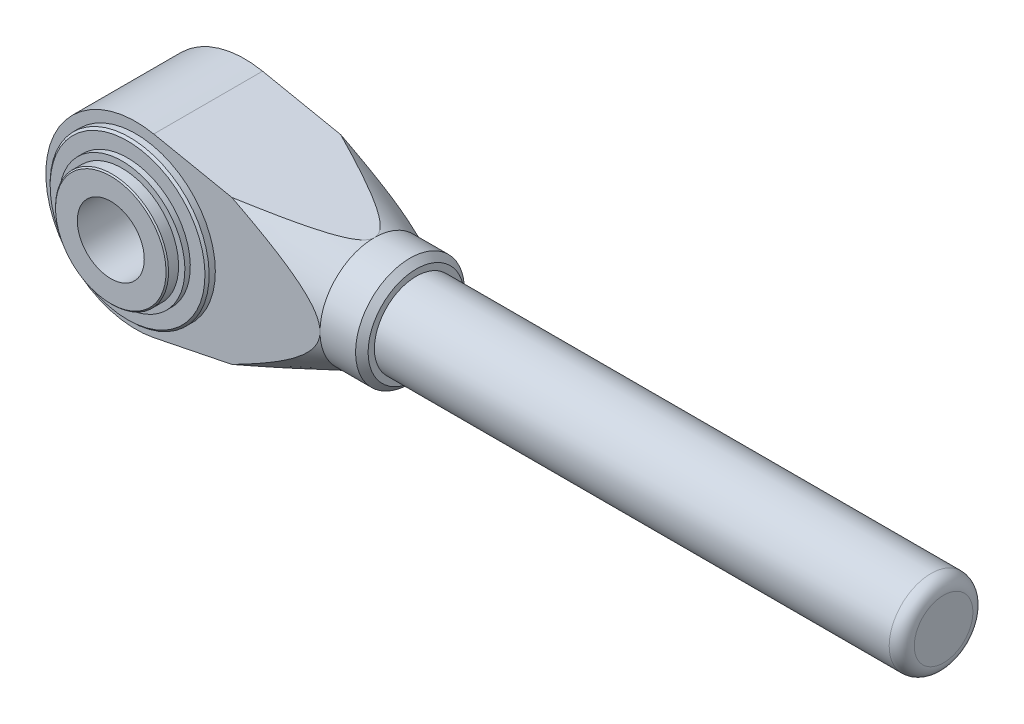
ISO-10303-21;
HEADER;
FILE_DESCRIPTION(('STEP AP214'),'2;1');
FILE_NAME('part.step','',(''),(''),'','','');
FILE_SCHEMA(('AUTOMOTIVE_DESIGN { 1 0 10303 214 1 1 1 1 }'));
ENDSEC;
DATA;
#1=APPLICATION_CONTEXT('core data for automotive mechanical design processes');
#2=APPLICATION_PROTOCOL_DEFINITION('international standard','automotive_design',2000,#1);
#3=PRODUCT_CONTEXT('',#1,'mechanical');
#4=PRODUCT('Part','Part','',(#3));
#5=PRODUCT_RELATED_PRODUCT_CATEGORY('part','',(#4));
#6=PRODUCT_DEFINITION_FORMATION('','',#4);
#7=PRODUCT_DEFINITION_CONTEXT('part definition',#1,'design');
#8=PRODUCT_DEFINITION('design','',#6,#7);
#9=PRODUCT_DEFINITION_SHAPE('','',#8);
#10=(LENGTH_UNIT() NAMED_UNIT(*) SI_UNIT(.MILLI.,.METRE.));
#11=(NAMED_UNIT(*) PLANE_ANGLE_UNIT() SI_UNIT($,.RADIAN.));
#12=(NAMED_UNIT(*) SI_UNIT($,.STERADIAN.) SOLID_ANGLE_UNIT());
#13=UNCERTAINTY_MEASURE_WITH_UNIT(LENGTH_MEASURE(1.E-05),#10,'distance_accuracy_value','');
#14=(GEOMETRIC_REPRESENTATION_CONTEXT(3) GLOBAL_UNCERTAINTY_ASSIGNED_CONTEXT((#13)) GLOBAL_UNIT_ASSIGNED_CONTEXT((#10,
#11,#12)) REPRESENTATION_CONTEXT('',''));
#15=CARTESIAN_POINT('',(0.,0.,0.));
#16=DIRECTION('',(0.,0.,1.));
#17=DIRECTION('',(1.,0.,0.));
#18=AXIS2_PLACEMENT_3D('',#15,#16,#17);
#19=CARTESIAN_POINT('',(0.,1.49880108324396E-12,32.0204567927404));
#20=DIRECTION('',(0.,0.,1.));
#21=DIRECTION('',(1.,0.,0.));
#22=AXIS2_PLACEMENT_3D('',#19,#20,#21);
#23=PLANE('',#22);
#24=CARTESIAN_POINT('',(-8.71651874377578,-32.045710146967,32.0204567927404));
#25=CARTESIAN_POINT('',(-7.47453920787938,-31.4969677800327,32.0204567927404));
#26=CARTESIAN_POINT('',(-6.2332732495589,-30.9466044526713,32.0204567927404));
#27=CARTESIAN_POINT('',(-3.75246636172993,-29.8419759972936,32.0204567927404));
#28=CARTESIAN_POINT('',(-2.51292544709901,-29.2877108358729,32.0204567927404));
#29=CARTESIAN_POINT('',(-0.0354734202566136,-28.174442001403,32.0204567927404));
#30=CARTESIAN_POINT('',(1.20243700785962,-27.6154368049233,32.0204567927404));
#31=CARTESIAN_POINT('',(3.67579255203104,-26.4920052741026,32.0204567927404));
#32=CARTESIAN_POINT('',(4.91123767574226,-25.9275789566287,32.0204567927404));
#33=CARTESIAN_POINT('',(7.3804477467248,-24.7916004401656,32.0204567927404));
#34=CARTESIAN_POINT('',(8.61420949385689,-24.2200412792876,32.0204567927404));
#35=CARTESIAN_POINT('',(11.0780106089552,-23.0689564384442,32.0204567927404));
#36=CARTESIAN_POINT('',(12.3080499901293,-22.4894307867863,32.0204567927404));
#37=CARTESIAN_POINT('',(14.7632219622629,-21.3205987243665,32.0204567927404));
#38=CARTESIAN_POINT('',(15.9883553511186,-20.7312939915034,32.0204567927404));
#39=CARTESIAN_POINT('',(18.4325484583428,-19.5402269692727,32.0204567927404));
#40=CARTESIAN_POINT('',(19.6516082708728,-18.9384648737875,32.0204567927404));
#41=CARTESIAN_POINT('',(21.4736762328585,-18.0239084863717,32.0204567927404));
#42=CARTESIAN_POINT('',(22.0797310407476,-17.7171819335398,32.0204567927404));
#43=CARTESIAN_POINT('',(23.2894562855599,-17.0990635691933,32.0204567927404));
#44=CARTESIAN_POINT('',(23.8931267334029,-16.7876717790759,32.0204567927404));
#45=CARTESIAN_POINT('',(25.0977955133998,-16.1594085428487,32.0204567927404));
#46=CARTESIAN_POINT('',(25.6987931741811,-15.8425358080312,32.0204567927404));
#47=CARTESIAN_POINT('',(26.897409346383,-15.2024611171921,32.0204567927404));
#48=CARTESIAN_POINT('',(27.4950278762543,-14.8792591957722,32.0204567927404));
#49=CARTESIAN_POINT('',(28.6874372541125,-14.2246647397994,32.0204567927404));
#50=CARTESIAN_POINT('',(29.2822192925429,-13.8932561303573,32.0204567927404));
#51=CARTESIAN_POINT('',(30.4666734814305,-13.2214320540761,32.0204567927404));
#52=CARTESIAN_POINT('',(31.0563457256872,-12.8810167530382,32.0204567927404));
#53=CARTESIAN_POINT('',(32.2289875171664,-12.1893780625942,32.0204567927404));
#54=CARTESIAN_POINT('',(32.8119598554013,-11.8381594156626,32.0204567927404));
#55=CARTESIAN_POINT('',(33.9695444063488,-11.1222173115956,32.0204567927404));
#56=CARTESIAN_POINT('',(34.5441572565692,-10.7574948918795,32.0204567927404));
#57=CARTESIAN_POINT('',(35.3993362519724,-10.196506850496,32.0204567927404));
#58=CARTESIAN_POINT('',(35.6840908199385,-10.0066206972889,32.0204567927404));
#59=CARTESIAN_POINT('',(36.2502532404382,-9.62192958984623,32.0204567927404));
#60=CARTESIAN_POINT('',(36.5316611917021,-9.42712478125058,32.0204567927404));
#61=CARTESIAN_POINT('',(37.0907281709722,-9.03175097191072,32.0204567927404));
#62=CARTESIAN_POINT('',(37.3683841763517,-8.83117768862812,32.0204567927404));
#63=CARTESIAN_POINT('',(37.9189171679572,-8.42357179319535,32.0204567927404));
#64=CARTESIAN_POINT('',(38.1917942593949,-8.21653932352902,32.0204567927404));
#65=CARTESIAN_POINT('',(38.7310315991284,-7.79553334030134,32.0204567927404));
#66=CARTESIAN_POINT('',(38.9974067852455,-7.58157901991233,32.0204567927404));
#67=CARTESIAN_POINT('',(39.5230095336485,-7.14496589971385,32.0204567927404));
#68=CARTESIAN_POINT('',(39.7822362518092,-6.92230607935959,32.0204567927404));
#69=CARTESIAN_POINT('',(40.2912966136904,-6.46709245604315,32.0204567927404));
#70=CARTESIAN_POINT('',(40.5411418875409,-6.23455172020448,32.0204567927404));
#71=CARTESIAN_POINT('',(41.029127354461,-5.75755900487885,32.0204567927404));
#72=CARTESIAN_POINT('',(41.2672715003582,-5.51311110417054,32.0204567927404));
#73=CARTESIAN_POINT('',(41.6845475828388,-5.05775779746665,32.0204567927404));
#74=CARTESIAN_POINT('',(41.866310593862,-4.84927412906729,32.0204567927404));
#75=CARTESIAN_POINT('',(42.2171053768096,-4.42168044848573,32.0204567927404));
#76=CARTESIAN_POINT('',(42.3861335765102,-4.20256748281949,32.0204567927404));
#77=CARTESIAN_POINT('',(42.707278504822,-3.75317854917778,32.0204567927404));
#78=CARTESIAN_POINT('',(42.8594466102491,-3.52293974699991,32.0204567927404));
#79=CARTESIAN_POINT('',(43.1426104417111,-3.04995529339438,32.0204567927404));
#80=CARTESIAN_POINT('',(43.2736226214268,-2.80721955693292,32.0204567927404));
#81=CARTESIAN_POINT('',(43.5317958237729,-2.25959586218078,32.0204567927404));
#82=CARTESIAN_POINT('',(43.6531595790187,-1.95185667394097,32.0204567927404));
#83=CARTESIAN_POINT('',(43.7974476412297,-1.47900707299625,32.0204567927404));
#84=CARTESIAN_POINT('',(43.8392457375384,-1.31955302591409,32.0204567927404));
#85=CARTESIAN_POINT('',(43.9090288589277,-0.997678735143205,32.0204567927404));
#86=CARTESIAN_POINT('',(43.9370205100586,-0.835259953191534,32.0204567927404));
#87=CARTESIAN_POINT('',(43.9783765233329,-0.507237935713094,32.0204567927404));
#88=CARTESIAN_POINT('',(43.9916221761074,-0.341619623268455,32.0204567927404));
#89=CARTESIAN_POINT('',(44.0025748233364,-0.00986978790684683,32.0204567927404));
#90=CARTESIAN_POINT('',(44.0002823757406,0.156261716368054,32.0204567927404));
#91=CARTESIAN_POINT('',(43.9802416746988,0.48769797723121,32.0204567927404));
#92=CARTESIAN_POINT('',(43.9624826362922,0.653002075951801,32.0204567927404));
#93=CARTESIAN_POINT('',(43.9121733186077,0.981336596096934,32.0204567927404));
#94=CARTESIAN_POINT('',(43.8796211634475,1.14436672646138,32.0204567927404));
#95=CARTESIAN_POINT('',(43.7939237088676,1.49542627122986,32.0204567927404));
#96=CARTESIAN_POINT('',(43.7381655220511,1.68281674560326,32.0204567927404));
#97=CARTESIAN_POINT('',(43.609998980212,2.05189050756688,32.0204567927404));
#98=CARTESIAN_POINT('',(43.5375783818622,2.23356948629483,32.0204567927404));
#99=CARTESIAN_POINT('',(43.3784091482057,2.59077759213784,32.0204567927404));
#100=CARTESIAN_POINT('',(43.2916414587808,2.76629815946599,32.0204567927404));
#101=CARTESIAN_POINT('',(43.106120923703,3.11078134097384,32.0204567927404));
#102=CARTESIAN_POINT('',(43.0073701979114,3.27974510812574,32.0204567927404));
#103=CARTESIAN_POINT('',(42.7141345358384,3.74836560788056,32.0204567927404));
#104=CARTESIAN_POINT('',(42.5079429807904,4.04070672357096,32.0204567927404));
#105=CARTESIAN_POINT('',(42.0715134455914,4.60686269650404,32.0204567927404));
#106=CARTESIAN_POINT('',(41.8412527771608,4.88065966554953,32.0204567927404));
#107=CARTESIAN_POINT('',(41.362301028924,5.4133570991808,32.0204567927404));
#108=CARTESIAN_POINT('',(41.113544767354,5.67219855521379,32.0204567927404));
#109=CARTESIAN_POINT('',(40.7305911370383,6.05025818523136,32.0204567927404));
#110=CARTESIAN_POINT('',(40.6013310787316,6.17455303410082,32.0204567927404));
#111=CARTESIAN_POINT('',(40.3399089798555,6.42005402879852,32.0204567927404));
#112=CARTESIAN_POINT('',(40.2077469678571,6.54126020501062,32.0204567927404));
#113=CARTESIAN_POINT('',(39.8077489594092,6.90038008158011,32.0204567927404));
#114=CARTESIAN_POINT('',(39.5361177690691,7.13407190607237,32.0204567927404));
#115=CARTESIAN_POINT('',(38.9849305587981,7.59194799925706,32.0204567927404));
#116=CARTESIAN_POINT('',(38.705373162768,7.81613059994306,32.0204567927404));
#117=CARTESIAN_POINT('',(38.139762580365,8.25651384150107,32.0204567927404));
#118=CARTESIAN_POINT('',(37.8537052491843,8.47270914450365,32.0204567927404));
#119=CARTESIAN_POINT('',(37.2764717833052,8.89810262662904,32.0204567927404));
#120=CARTESIAN_POINT('',(36.9852958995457,9.10730114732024,32.0204567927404));
#121=CARTESIAN_POINT('',(36.3980319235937,9.52013039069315,32.0204567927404));
#122=CARTESIAN_POINT('',(36.101934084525,9.72374722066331,32.0204567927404));
#123=CARTESIAN_POINT('',(35.5061649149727,10.1256909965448,32.0204567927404));
#124=CARTESIAN_POINT('',(35.2064934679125,10.3240177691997,32.0204567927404));
#125=CARTESIAN_POINT('',(34.302918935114,10.912096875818,32.0204567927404));
#126=CARTESIAN_POINT('',(33.6944972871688,11.2949190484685,32.0204567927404));
#127=CARTESIAN_POINT('',(32.7725768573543,11.8598933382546,32.0204567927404));
#128=CARTESIAN_POINT('',(32.4623632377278,12.0474638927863,32.0204567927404));
#129=CARTESIAN_POINT('',(31.8399760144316,12.4192784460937,32.0204567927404));
#130=CARTESIAN_POINT('',(31.5278025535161,12.6035226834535,32.0204567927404));
#131=CARTESIAN_POINT('',(30.588631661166,13.1518535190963,32.0204567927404));
#132=CARTESIAN_POINT('',(29.9590426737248,13.5115023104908,32.0204567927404));
#133=CARTESIAN_POINT('',(28.695505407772,14.2205752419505,32.0204567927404));
#134=CARTESIAN_POINT('',(28.0615659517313,14.5700151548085,32.0204567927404));
#135=CARTESIAN_POINT('',(27.107425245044,15.0881830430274,32.0204567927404));
#136=CARTESIAN_POINT('',(26.7888446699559,15.259904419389,32.0204567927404));
#137=CARTESIAN_POINT('',(26.1507031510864,15.6015172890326,32.0204567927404));
#138=CARTESIAN_POINT('',(25.8311422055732,15.7714087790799,32.0204567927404));
#139=CARTESIAN_POINT('',(24.8604647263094,16.2842060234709,32.0204567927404));
#140=CARTESIAN_POINT('',(24.2079605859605,16.6244869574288,32.0204567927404));
#141=CARTESIAN_POINT('',(22.8999257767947,17.2991872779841,32.0204567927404));
#142=CARTESIAN_POINT('',(22.2443950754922,17.6336066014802,32.0204567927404));
#143=CARTESIAN_POINT('',(20.930773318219,18.2974354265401,32.0204567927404));
#144=CARTESIAN_POINT('',(20.2726821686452,18.6268447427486,32.0204567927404));
#145=CARTESIAN_POINT('',(18.9543427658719,19.2813207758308,32.0204567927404));
#146=CARTESIAN_POINT('',(18.294094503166,19.606387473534,32.0204567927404));
#147=CARTESIAN_POINT('',(16.3103917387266,20.5760354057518,32.0204567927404));
#148=CARTESIAN_POINT('',(14.984174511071,21.2149662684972,32.0204567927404));
#149=CARTESIAN_POINT('',(12.3261987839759,22.4811957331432,32.0204567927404));
#150=CARTESIAN_POINT('',(10.9944402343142,23.1084942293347,32.0204567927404));
#151=CARTESIAN_POINT('',(8.99266260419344,24.0429263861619,32.0204567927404));
#152=CARTESIAN_POINT('',(8.32425855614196,24.3535263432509,32.0204567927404));
#153=CARTESIAN_POINT('',(6.9864881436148,24.9726373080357,32.0204567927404));
#154=CARTESIAN_POINT('',(6.31712178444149,25.2811483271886,32.0204567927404));
#155=CARTESIAN_POINT('',(4.3077250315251,26.203876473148,32.0204567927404));
#156=CARTESIAN_POINT('',(2.96640463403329,26.8152851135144,32.0204567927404));
#157=CARTESIAN_POINT('',(0.281115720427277,28.0319103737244,32.0204567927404));
#158=CARTESIAN_POINT('',(-1.06285253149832,28.6371275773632,32.0204567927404));
#159=CARTESIAN_POINT('',(-3.7530749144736,29.842451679,32.0204567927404));
#160=CARTESIAN_POINT('',(-5.09932904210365,30.4425585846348,32.0204567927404));
#161=CARTESIAN_POINT('',(-8.95731445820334,32.1549634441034,32.0204567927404));
#162=CARTESIAN_POINT('',(-11.4713923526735,33.2619742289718,32.0204567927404));
#163=CARTESIAN_POINT('',(-16.5044363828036,35.4650092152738,32.0204567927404));
#164=CARTESIAN_POINT('',(-19.0234026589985,36.5610330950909,32.0204567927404));
#165=CARTESIAN_POINT('',(-24.0597238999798,38.7423393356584,32.0204567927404));
#166=CARTESIAN_POINT('',(-26.5770712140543,39.8276393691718,32.0204567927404));
#167=CARTESIAN_POINT('',(-30.3551738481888,41.4506103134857,32.0204567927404));
#168=CARTESIAN_POINT('',(-31.6148651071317,41.9907608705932,32.0204567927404));
#169=CARTESIAN_POINT('',(-34.1348822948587,43.0695774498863,32.0204567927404));
#170=CARTESIAN_POINT('',(-35.3952082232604,43.6082434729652,32.0204567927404));
#171=CARTESIAN_POINT('',(-36.6558149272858,44.1462517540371,32.0204567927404));
#172=B_SPLINE_CURVE_WITH_KNOTS('',3,(#24,#25,#26,#27,#28,#29,#30,#31,#32,#33,#34,#35,#36,#37,
#38,#39,#40,#41,#42,#43,#44,#45,#46,#47,#48,#49,#50,#51,#52,#53,#54,#55,#56,#57,#58,#59,#60,#61,
#62,#63,#64,#65,#66,#67,#68,#69,#70,#71,#72,#73,#74,#75,#76,#77,#78,#79,#80,#81,#82,#83,#84,#85,
#86,#87,#88,#89,#90,#91,#92,#93,#94,#95,#96,#97,#98,#99,#100,#101,#102,#103,#104,#105,#106,#107,
#108,#109,#110,#111,#112,#113,#114,#115,#116,#117,#118,#119,#120,#121,#122,#123,#124,#125,#126,
#127,#128,#129,#130,#131,#132,#133,#134,#135,#136,#137,#138,#139,#140,#141,#142,#143,#144,#145,
#146,#147,#148,#149,#150,#151,#152,#153,#154,#155,#156,#157,#158,#159,#160,#161,#162,#163,#164,
#165,#166,#167,#168,#169,#170,#171),.UNSPECIFIED.,.F.,.F.,(4,2,2,2,2,2,2,2,2,2,2,2,2,2,2,2,2,2,
2,2,2,2,2,2,2,2,2,2,2,2,2,2,2,2,2,2,2,2,2,2,2,2,2,2,2,2,2,2,2,2,2,2,2,2,2,2,2,2,2,2,2,2,2,2,2,2,
2,2,2,2,2,2,2,4),(0.,4.0734140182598,8.14686295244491,12.2216748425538,16.2964740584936,
20.3756218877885,24.4547552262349,28.5331957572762,32.6115728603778,34.6493135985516,
36.6870449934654,38.7252622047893,40.7634682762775,42.8060442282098,44.8485826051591,
46.89023679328,48.9317344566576,49.9584733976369,50.9851819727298,52.0126735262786,
53.0401424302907,54.0649723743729,55.0899228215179,56.1135576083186,57.136844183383,
57.9662204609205,58.7958285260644,59.6228346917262,60.449194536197,61.4376627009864,
61.9316816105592,62.4254631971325,62.9231917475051,63.4209024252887,63.9189604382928,
64.4170816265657,65.0026994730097,65.5887490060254,66.1755832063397,66.762313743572,
67.8336365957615,68.9059785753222,69.9822972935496,70.5202346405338,71.0581666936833,
72.1328438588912,73.2077087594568,74.2832794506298,75.3587975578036,76.4367860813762,
77.5148098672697,79.6710094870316,80.7585350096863,81.845982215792,84.0210837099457,
86.1926248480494,87.2783620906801,88.3641012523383,90.5717700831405,92.7794626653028,
94.9872367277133,97.1950205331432,101.611243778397,106.027507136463,108.238641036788,
110.449762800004,114.872031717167,119.293879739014,123.715721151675,131.956708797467,
140.197936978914,148.421926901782,152.533770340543,156.645611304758),.UNSPECIFIED.);
#173=CARTESIAN_POINT('',(22.9361329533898,17.279424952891,32.0204567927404));
#174=VERTEX_POINT('',#173);
#175=CARTESIAN_POINT('',(44.,1.49880108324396E-12,32.0204567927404));
#176=VERTEX_POINT('',#175);
#177=EDGE_CURVE('E81',#174,#176,#172,.F.);
#178=ORIENTED_EDGE('',*,*,#177,.F.);
#179=DIRECTION('',(-0.979979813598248,0.199096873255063,0.));
#180=VECTOR('',#179,1.);
#181=CARTESIAN_POINT('',(44.,13.0000000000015,32.0204567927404));
#182=LINE('',#181,#180);
#183=CARTESIAN_POINT('',(4.28058277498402,21.069565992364,32.0204567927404));
#184=VERTEX_POINT('',#183);
#185=EDGE_CURVE('E102',#174,#184,#182,.T.);
#186=ORIENTED_EDGE('',*,*,#185,.T.);
#187=CARTESIAN_POINT('',(0.,1.49880108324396E-12,32.0204567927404));
#188=DIRECTION('',(0.,0.,1.));
#189=DIRECTION('',(1.,0.,0.));
#190=AXIS2_PLACEMENT_3D('',#187,#188,#189);
#191=CIRCLE('',#190,21.5);
#192=CARTESIAN_POINT('',(4.28058277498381,-21.069565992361,32.0204567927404));
#193=VERTEX_POINT('',#192);
#194=EDGE_CURVE('E165',#184,#193,#191,.T.);
#195=ORIENTED_EDGE('',*,*,#194,.T.);
#196=DIRECTION('',(-0.979979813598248,-0.199096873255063,0.));
#197=VECTOR('',#196,1.);
#198=CARTESIAN_POINT('',(44.,-12.9999999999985,32.0204567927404));
#199=LINE('',#198,#197);
#200=CARTESIAN_POINT('',(22.9361329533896,-17.279424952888,32.0204567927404));
#201=VERTEX_POINT('',#200);
#202=EDGE_CURVE('E162',#201,#193,#199,.T.);
#203=ORIENTED_EDGE('',*,*,#202,.F.);
#204=EDGE_CURVE('E104',#176,#201,#172,.F.);
#205=ORIENTED_EDGE('',*,*,#204,.F.);
#206=EDGE_LOOP('',(#178,#186,#195,#203,#205));
#207=FACE_BOUND('',#206,.T.);
#208=CARTESIAN_POINT('',(0.,0.,32.0204567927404));
#209=DIRECTION('',(0.,0.,1.));
#210=DIRECTION('',(1.,0.,0.));
#211=AXIS2_PLACEMENT_3D('',#208,#209,#210);
#212=CIRCLE('',#211,19.);
#213=CARTESIAN_POINT('',(19.,0.,32.0204567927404));
#214=VERTEX_POINT('',#213);
#215=EDGE_CURVE('E139',#214,#214,#212,.F.);
#216=ORIENTED_EDGE('',*,*,#215,.T.);
#217=EDGE_LOOP('',(#216));
#218=FACE_BOUND('',#217,.T.);
#219=ADVANCED_FACE('F15',(#207,#218),#23,.T.);
#220=CARTESIAN_POINT('',(44.,13.0000000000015,32.0204567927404));
#221=DIRECTION('',(-0.199096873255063,-0.979979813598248,0.));
#222=DIRECTION('',(0.979979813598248,-0.199096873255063,0.));
#223=AXIS2_PLACEMENT_3D('',#220,#221,#222);
#224=PLANE('',#223);
#225=ORIENTED_EDGE('',*,*,#185,.F.);
#226=CARTESIAN_POINT('',(22.9356462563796,17.279523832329,32.0206567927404));
#227=CARTESIAN_POINT('',(23.5206233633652,17.1606773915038,31.7802415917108));
#228=CARTESIAN_POINT('',(24.1050527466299,17.0419422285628,31.5384278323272));
#229=CARTESIAN_POINT('',(25.2725645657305,16.804745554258,31.0513750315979));
#230=CARTESIAN_POINT('',(25.8556469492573,16.6862840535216,30.8061358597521));
#231=CARTESIAN_POINT('',(27.0211089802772,16.4495038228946,30.3112229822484));
#232=CARTESIAN_POINT('',(27.6034859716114,16.3311856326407,30.0615427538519));
#233=CARTESIAN_POINT('',(28.7661938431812,16.0949649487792,29.5572910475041));
#234=CARTESIAN_POINT('',(29.3465247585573,15.9770624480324,29.3027196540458));
#235=CARTESIAN_POINT('',(30.5224516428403,15.7381561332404,28.7796509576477));
#236=CARTESIAN_POINT('',(31.1179676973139,15.6171685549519,28.5109661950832));
#237=CARTESIAN_POINT('',(32.3054646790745,15.3759116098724,27.9655862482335));
#238=CARTESIAN_POINT('',(32.8974456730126,15.2556422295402,27.6888912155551));
#239=CARTESIAN_POINT('',(34.0762198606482,15.0161574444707,27.1253802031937));
#240=CARTESIAN_POINT('',(34.6630167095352,14.8969412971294,26.8385722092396));
#241=CARTESIAN_POINT('',(35.8299829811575,14.6598554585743,26.251290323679));
#242=CARTESIAN_POINT('',(36.4101531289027,14.5419856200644,25.9508179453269));
#243=CARTESIAN_POINT('',(37.4157847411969,14.3376772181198,25.4089286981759));
#244=CARTESIAN_POINT('',(37.8434073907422,14.2507995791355,25.1716991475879));
#245=CARTESIAN_POINT('',(38.6912420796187,14.0785498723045,24.6829740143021));
#246=CARTESIAN_POINT('',(39.1114487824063,13.9931788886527,24.4314686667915));
#247=CARTESIAN_POINT('',(39.7321997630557,13.8670644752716,24.0401241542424));
#248=CARTESIAN_POINT('',(39.9371598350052,13.8254239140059,23.9075817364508));
#249=CARTESIAN_POINT('',(40.3433646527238,13.7428976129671,23.6367109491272));
#250=CARTESIAN_POINT('',(40.5446097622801,13.7020117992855,23.4983831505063));
#251=CARTESIAN_POINT('',(40.9421184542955,13.6212522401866,23.21488215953));
#252=CARTESIAN_POINT('',(41.1383870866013,13.5813774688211,23.0697163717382));
#253=CARTESIAN_POINT('',(41.5245552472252,13.5029219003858,22.7708581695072));
#254=CARTESIAN_POINT('',(41.7144567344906,13.464340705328,22.6171684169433));
#255=CARTESIAN_POINT('',(42.0349811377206,13.3992216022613,22.3424430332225));
#256=CARTESIAN_POINT('',(42.1676616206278,13.3722656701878,22.2239151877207));
#257=CARTESIAN_POINT('',(42.4270724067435,13.3195626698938,21.9801173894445));
#258=CARTESIAN_POINT('',(42.5538005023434,13.2938160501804,21.8548449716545));
#259=CARTESIAN_POINT('',(42.7989039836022,13.2440197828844,21.5967763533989));
#260=CARTESIAN_POINT('',(42.9173051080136,13.2199649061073,21.4640058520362));
#261=CARTESIAN_POINT('',(43.1432865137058,13.1740535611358,21.189279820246));
#262=CARTESIAN_POINT('',(43.2508762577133,13.1521951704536,21.0473325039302));
#263=CARTESIAN_POINT('',(43.4533277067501,13.1110642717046,20.7497280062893));
#264=CARTESIAN_POINT('',(43.5478816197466,13.0918542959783,20.593848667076));
#265=CARTESIAN_POINT('',(43.7153123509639,13.0578383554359,20.2702393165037));
#266=CARTESIAN_POINT('',(43.7882108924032,13.0430279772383,20.1025213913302));
#267=CARTESIAN_POINT('',(43.8960566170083,13.0211175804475,19.7821015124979));
#268=CARTESIAN_POINT('',(43.9350177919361,13.0132020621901,19.6308381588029));
#269=CARTESIAN_POINT('',(43.987203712,13.0025997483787,19.3237955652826));
#270=CARTESIAN_POINT('',(44.0004620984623,12.9999061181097,19.1680224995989));
#271=CARTESIAN_POINT('',(43.999512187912,13.0000991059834,18.8562828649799));
#272=CARTESIAN_POINT('',(43.9852544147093,13.0029957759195,18.7003164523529));
#273=CARTESIAN_POINT('',(43.9311119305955,13.0139955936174,18.3930759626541));
#274=CARTESIAN_POINT('',(43.8911957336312,13.0221051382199,18.2418078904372));
#275=CARTESIAN_POINT('',(43.7703134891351,13.0466640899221,17.889165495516));
#276=CARTESIAN_POINT('',(43.6793878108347,13.0651369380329,17.6914064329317));
#277=CARTESIAN_POINT('',(43.4690743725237,13.1078651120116,17.3124435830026));
#278=CARTESIAN_POINT('',(43.3496102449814,13.1321359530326,17.1312860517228));
#279=CARTESIAN_POINT('',(43.060653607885,13.1908416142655,16.7419255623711));
#280=CARTESIAN_POINT('',(42.8860457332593,13.2263156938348,16.537749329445));
#281=CARTESIAN_POINT('',(42.5184317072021,13.3010017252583,16.1472107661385));
#282=CARTESIAN_POINT('',(42.3253898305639,13.3402209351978,15.9608844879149));
#283=CARTESIAN_POINT('',(41.9260255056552,13.4213574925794,15.6011271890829));
#284=CARTESIAN_POINT('',(41.7196264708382,13.4632903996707,15.4277856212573));
#285=CARTESIAN_POINT('',(41.4038268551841,13.5274495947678,15.1762209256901));
#286=CARTESIAN_POINT('',(41.2975764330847,13.5490358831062,15.0938094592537));
#287=CARTESIAN_POINT('',(41.0832721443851,13.5925748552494,14.931467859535));
#288=CARTESIAN_POINT('',(40.9752183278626,13.6145275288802,14.8515376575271));
#289=CARTESIAN_POINT('',(40.6298993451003,13.6846840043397,14.6013879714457));
#290=CARTESIAN_POINT('',(40.3897809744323,13.7334674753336,14.4352666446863));
#291=CARTESIAN_POINT('',(39.9042393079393,13.832112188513,14.1112706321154));
#292=CARTESIAN_POINT('',(39.6588149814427,13.8819736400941,13.9533975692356));
#293=CARTESIAN_POINT('',(39.1637967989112,13.9825436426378,13.6442683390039));
#294=CARTESIAN_POINT('',(38.9142004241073,14.0332527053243,13.4930163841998));
#295=CARTESIAN_POINT('',(38.4118509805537,14.1353121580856,13.1960609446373));
#296=CARTESIAN_POINT('',(38.1590977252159,14.1866625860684,13.0503577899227));
#297=CARTESIAN_POINT('',(37.395816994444,14.3417339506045,12.6194543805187));
#298=CARTESIAN_POINT('',(36.8815125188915,14.4462222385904,12.3412227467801));
#299=CARTESIAN_POINT('',(35.8463800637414,14.6565241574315,11.7983131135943));
#300=CARTESIAN_POINT('',(35.3255544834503,14.7623373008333,11.5336303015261));
#301=CARTESIAN_POINT('',(34.2788231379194,14.9749956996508,11.0143418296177));
#302=CARTESIAN_POINT('',(33.7529151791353,15.0818414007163,10.7597407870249));
#303=CARTESIAN_POINT('',(32.6974403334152,15.296276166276,10.2584694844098));
#304=CARTESIAN_POINT('',(32.1678731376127,15.403865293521,10.011799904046));
#305=CARTESIAN_POINT('',(31.1066535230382,15.6194671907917,9.52513715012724));
#306=CARTESIAN_POINT('',(30.5750048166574,15.7274792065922,9.28513552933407));
#307=CARTESIAN_POINT('',(29.5094997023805,15.9439517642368,8.81028905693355));
#308=CARTESIAN_POINT('',(28.9756432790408,16.0524123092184,8.57544424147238));
#309=CARTESIAN_POINT('',(27.983437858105,16.2539929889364,8.14366026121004));
#310=CARTESIAN_POINT('',(27.5253278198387,16.3470645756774,7.94614838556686));
#311=CARTESIAN_POINT('',(26.6078802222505,16.5334571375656,7.55376151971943));
#312=CARTESIAN_POINT('',(26.1485423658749,16.6267781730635,7.35888725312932));
#313=CARTESIAN_POINT('',(25.2306740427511,16.8132562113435,6.97220603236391));
#314=CARTESIAN_POINT('',(24.7721471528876,16.9064124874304,6.78039022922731));
#315=CARTESIAN_POINT('',(23.8544100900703,17.0928638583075,6.39884387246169));
#316=CARTESIAN_POINT('',(23.395200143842,17.1861589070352,6.20911275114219));
#317=CARTESIAN_POINT('',(22.9356462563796,17.279523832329,6.02025679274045));
#318=B_SPLINE_CURVE_WITH_KNOTS('',3,(#226,#227,#228,#229,#230,#231,#232,#233,#234,#235,#236,
#237,#238,#239,#240,#241,#242,#243,#244,#245,#246,#247,#248,#249,#250,#251,#252,#253,#254,#255,
#256,#257,#258,#259,#260,#261,#262,#263,#264,#265,#266,#267,#268,#269,#270,#271,#272,#273,#274,
#275,#276,#277,#278,#279,#280,#281,#282,#283,#284,#285,#286,#287,#288,#289,#290,#291,#292,#293,
#294,#295,#296,#297,#298,#299,#300,#301,#302,#303,#304,#305,#306,#307,#308,#309,#310,#311,#312,
#313,#314,#315,#316,#317),.UNSPECIFIED.,.F.,.F.,(4,2,2,2,2,2,2,2,2,2,2,2,2,2,2,2,2,2,2,2,2,2,2,
2,2,2,2,2,2,2,2,2,2,2,2,2,2,2,2,2,2,2,2,2,2,4),(0.,1.93057399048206,3.86122173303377,
5.79498779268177,7.7287204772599,9.72196989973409,11.7151816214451,13.7068531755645,
15.6983046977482,17.1881668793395,18.6790607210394,19.4218136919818,20.1644935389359,
20.9063868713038,21.6480498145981,22.1877023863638,22.7275535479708,23.2656551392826,
23.8032815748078,24.351981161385,24.9001284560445,25.3673518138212,25.8339632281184,
26.3014144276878,26.7694403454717,27.4210174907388,28.0743581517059,28.8854014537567,
29.6980497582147,30.5158612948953,30.9243963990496,31.332920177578,32.2207650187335,
33.1087838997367,33.9973597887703,34.8859884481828,36.6676853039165,38.4487448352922,
40.2306108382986,42.0126291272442,43.7922761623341,45.571935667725,47.0943727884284,
48.6172194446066,50.1342724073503,51.6509014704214),.UNSPECIFIED.);
#319=CARTESIAN_POINT('',(44.,13.0000000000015,19.0204567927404));
#320=VERTEX_POINT('',#319);
#321=EDGE_CURVE('E79',#174,#320,#318,.T.);
#322=ORIENTED_EDGE('',*,*,#321,.T.);
#323=CARTESIAN_POINT('',(22.93613295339,17.279424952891,6.02045679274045));
#324=VERTEX_POINT('',#323);
#325=EDGE_CURVE('E91',#320,#324,#318,.T.);
#326=ORIENTED_EDGE('',*,*,#325,.T.);
#327=DIRECTION('',(-0.979979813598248,0.199096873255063,0.));
#328=VECTOR('',#327,1.);
#329=CARTESIAN_POINT('',(44.,13.0000000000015,6.02045679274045));
#330=LINE('',#329,#328);
#331=CARTESIAN_POINT('',(4.28058277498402,21.069565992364,6.02045679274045));
#332=VERTEX_POINT('',#331);
#333=EDGE_CURVE('E155',#324,#332,#330,.T.);
#334=ORIENTED_EDGE('',*,*,#333,.T.);
#335=DIRECTION('',(0.,0.,-1.));
#336=VECTOR('',#335,1.);
#337=CARTESIAN_POINT('',(4.28058277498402,21.069565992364,32.0204567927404));
#338=LINE('',#337,#336);
#339=EDGE_CURVE('E115',#184,#332,#338,.T.);
#340=ORIENTED_EDGE('',*,*,#339,.F.);
#341=EDGE_LOOP('',(#225,#322,#326,#334,#340));
#342=FACE_BOUND('',#341,.T.);
#343=ADVANCED_FACE('F100',(#342),#224,.F.);
#344=CARTESIAN_POINT('',(0.,1.49880108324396E-12,32.0204567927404));
#345=DIRECTION('',(0.,0.,-1.));
#346=DIRECTION('',(-1.,0.,0.));
#347=AXIS2_PLACEMENT_3D('',#344,#345,#346);
#348=CYLINDRICAL_SURFACE('',#347,21.5);
#349=ORIENTED_EDGE('',*,*,#339,.T.);
#350=CARTESIAN_POINT('',(0.,1.49880108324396E-12,6.02045679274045));
#351=DIRECTION('',(0.,0.,1.));
#352=DIRECTION('',(1.,0.,0.));
#353=AXIS2_PLACEMENT_3D('',#350,#351,#352);
#354=CIRCLE('',#353,21.5);
#355=CARTESIAN_POINT('',(4.28058277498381,-21.069565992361,6.02045679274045));
#356=VERTEX_POINT('',#355);
#357=EDGE_CURVE('E147',#332,#356,#354,.T.);
#358=ORIENTED_EDGE('',*,*,#357,.T.);
#359=DIRECTION('',(0.,0.,-1.));
#360=VECTOR('',#359,1.);
#361=CARTESIAN_POINT('',(4.28058277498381,-21.069565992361,32.0204567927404));
#362=LINE('',#361,#360);
#363=EDGE_CURVE('E170',#193,#356,#362,.T.);
#364=ORIENTED_EDGE('',*,*,#363,.F.);
#365=ORIENTED_EDGE('',*,*,#194,.F.);
#366=EDGE_LOOP('',(#349,#358,#364,#365));
#367=FACE_BOUND('',#366,.T.);
#368=ADVANCED_FACE('F180',(#367),#348,.T.);
#369=CARTESIAN_POINT('',(44.,-12.9999999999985,32.0204567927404));
#370=DIRECTION('',(0.199096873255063,-0.979979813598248,0.));
#371=DIRECTION('',(0.979979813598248,0.199096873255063,0.));
#372=AXIS2_PLACEMENT_3D('',#369,#370,#371);
#373=PLANE('',#372);
#374=CARTESIAN_POINT('',(22.9356462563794,-17.279523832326,32.0206567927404));
#375=CARTESIAN_POINT('',(23.520623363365,-17.1606773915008,31.7802415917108));
#376=CARTESIAN_POINT('',(24.1050527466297,-17.0419422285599,31.5384278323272));
#377=CARTESIAN_POINT('',(25.2725645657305,-16.8047455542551,31.051375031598));
#378=CARTESIAN_POINT('',(25.8556469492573,-16.6862840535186,30.8061358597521));
#379=CARTESIAN_POINT('',(27.0211089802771,-16.4495038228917,30.3112229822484));
#380=CARTESIAN_POINT('',(27.6034859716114,-16.3311856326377,30.0615427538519));
#381=CARTESIAN_POINT('',(28.7661938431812,-16.0949649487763,29.5572910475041));
#382=CARTESIAN_POINT('',(29.3465247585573,-15.9770624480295,29.3027196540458));
#383=CARTESIAN_POINT('',(30.5224516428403,-15.7381561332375,28.7796509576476));
#384=CARTESIAN_POINT('',(31.1179676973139,-15.6171685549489,28.5109661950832));
#385=CARTESIAN_POINT('',(32.3054646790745,-15.3759116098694,27.9655862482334));
#386=CARTESIAN_POINT('',(32.8974456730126,-15.2556422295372,27.6888912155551));
#387=CARTESIAN_POINT('',(34.0762198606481,-15.0161574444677,27.1253802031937));
#388=CARTESIAN_POINT('',(34.6630167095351,-14.8969412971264,26.8385722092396));
#389=CARTESIAN_POINT('',(35.8299829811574,-14.6598554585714,26.251290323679));
#390=CARTESIAN_POINT('',(36.4101531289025,-14.5419856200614,25.9508179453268));
#391=CARTESIAN_POINT('',(37.4157847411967,-14.3376772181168,25.4089286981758));
#392=CARTESIAN_POINT('',(37.843407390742,-14.2507995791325,25.171699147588));
#393=CARTESIAN_POINT('',(38.6912420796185,-14.0785498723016,24.6829740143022));
#394=CARTESIAN_POINT('',(39.1114487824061,-13.9931788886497,24.4314686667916));
#395=CARTESIAN_POINT('',(39.7321997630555,-13.8670644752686,24.0401241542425));
#396=CARTESIAN_POINT('',(39.937159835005,-13.8254239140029,23.9075817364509));
#397=CARTESIAN_POINT('',(40.3433646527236,-13.7428976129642,23.6367109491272));
#398=CARTESIAN_POINT('',(40.5446097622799,-13.7020117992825,23.4983831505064));
#399=CARTESIAN_POINT('',(40.9421184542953,-13.6212522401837,23.2148821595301));
#400=CARTESIAN_POINT('',(41.138387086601,-13.5813774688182,23.0697163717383));
#401=CARTESIAN_POINT('',(41.524555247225,-13.5029219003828,22.7708581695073));
#402=CARTESIAN_POINT('',(41.7144567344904,-13.4643407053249,22.6171684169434));
#403=CARTESIAN_POINT('',(42.0349811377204,-13.3992216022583,22.3424430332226));
#404=CARTESIAN_POINT('',(42.1676616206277,-13.3722656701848,22.2239151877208));
#405=CARTESIAN_POINT('',(42.4270724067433,-13.3195626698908,21.9801173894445));
#406=CARTESIAN_POINT('',(42.5538005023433,-13.2938160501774,21.8548449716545));
#407=CARTESIAN_POINT('',(42.7989039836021,-13.2440197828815,21.5967763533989));
#408=CARTESIAN_POINT('',(42.9173051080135,-13.2199649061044,21.4640058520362));
#409=CARTESIAN_POINT('',(43.1432865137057,-13.1740535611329,21.1892798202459));
#410=CARTESIAN_POINT('',(43.2508762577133,-13.1521951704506,21.0473325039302));
#411=CARTESIAN_POINT('',(43.4533277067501,-13.1110642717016,20.7497280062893));
#412=CARTESIAN_POINT('',(43.5478816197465,-13.0918542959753,20.593848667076));
#413=CARTESIAN_POINT('',(43.7153123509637,-13.057838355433,20.2702393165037));
#414=CARTESIAN_POINT('',(43.7882108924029,-13.0430279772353,20.1025213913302));
#415=CARTESIAN_POINT('',(43.8960566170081,-13.0211175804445,19.7821015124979));
#416=CARTESIAN_POINT('',(43.935017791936,-13.0132020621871,19.6308381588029));
#417=CARTESIAN_POINT('',(43.9872037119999,-13.0025997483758,19.3237955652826));
#418=CARTESIAN_POINT('',(44.0004620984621,-12.9999061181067,19.1680224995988));
#419=CARTESIAN_POINT('',(43.9995121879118,-13.0000991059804,18.8562828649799));
#420=CARTESIAN_POINT('',(43.9852544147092,-13.0029957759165,18.7003164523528));
#421=CARTESIAN_POINT('',(43.9311119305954,-13.0139955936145,18.3930759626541));
#422=CARTESIAN_POINT('',(43.8911957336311,-13.022105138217,18.2418078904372));
#423=CARTESIAN_POINT('',(43.7703134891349,-13.0466640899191,17.8891654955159));
#424=CARTESIAN_POINT('',(43.6793878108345,-13.0651369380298,17.6914064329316));
#425=CARTESIAN_POINT('',(43.4690743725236,-13.1078651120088,17.3124435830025));
#426=CARTESIAN_POINT('',(43.3496102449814,-13.1321359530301,17.1312860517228));
#427=CARTESIAN_POINT('',(43.060653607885,-13.1908416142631,16.741925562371));
#428=CARTESIAN_POINT('',(42.8860457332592,-13.226315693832,16.5377493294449));
#429=CARTESIAN_POINT('',(42.5184317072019,-13.3010017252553,16.1472107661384));
#430=CARTESIAN_POINT('',(42.3253898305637,-13.3402209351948,15.9608844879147));
#431=CARTESIAN_POINT('',(41.926025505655,-13.4213574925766,15.6011271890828));
#432=CARTESIAN_POINT('',(41.7196264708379,-13.4632903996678,15.4277856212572));
#433=CARTESIAN_POINT('',(41.4038268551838,-13.5274495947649,15.1762209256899));
#434=CARTESIAN_POINT('',(41.2975764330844,-13.5490358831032,15.0938094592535));
#435=CARTESIAN_POINT('',(41.0832721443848,-13.5925748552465,14.9314678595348));
#436=CARTESIAN_POINT('',(40.9752183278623,-13.6145275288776,14.851537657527));
#437=CARTESIAN_POINT('',(40.6298993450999,-13.6846840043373,14.6013879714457));
#438=CARTESIAN_POINT('',(40.3897809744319,-13.7334674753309,14.4352666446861));
#439=CARTESIAN_POINT('',(39.9042393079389,-13.83211218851,14.1112706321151));
#440=CARTESIAN_POINT('',(39.6588149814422,-13.8819736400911,13.9533975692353));
#441=CARTESIAN_POINT('',(39.1637967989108,-13.982543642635,13.6442683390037));
#442=CARTESIAN_POINT('',(38.9142004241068,-14.0332527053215,13.4930163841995));
#443=CARTESIAN_POINT('',(38.4118509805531,-14.1353121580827,13.1960609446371));
#444=CARTESIAN_POINT('',(38.1590977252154,-14.1866625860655,13.0503577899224));
#445=CARTESIAN_POINT('',(37.3958169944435,-14.3417339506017,12.6194543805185));
#446=CARTESIAN_POINT('',(36.8815125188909,-14.4462222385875,12.3412227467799));
#447=CARTESIAN_POINT('',(35.8463800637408,-14.6565241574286,11.798313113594));
#448=CARTESIAN_POINT('',(35.3255544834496,-14.7623373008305,11.5336303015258));
#449=CARTESIAN_POINT('',(34.2788231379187,-14.974995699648,11.0143418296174));
#450=CARTESIAN_POINT('',(33.7529151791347,-15.0818414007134,10.7597407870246));
#451=CARTESIAN_POINT('',(32.6974403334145,-15.2962761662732,10.2584694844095));
#452=CARTESIAN_POINT('',(32.167873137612,-15.4038652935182,10.0117999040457));
#453=CARTESIAN_POINT('',(31.1066535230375,-15.6194671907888,9.52513715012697));
#454=CARTESIAN_POINT('',(30.5750048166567,-15.7274792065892,9.28513552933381));
#455=CARTESIAN_POINT('',(29.5094997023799,-15.943951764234,8.81028905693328));
#456=CARTESIAN_POINT('',(28.9756432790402,-16.0524123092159,8.57544424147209));
#457=CARTESIAN_POINT('',(27.9834378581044,-16.2539929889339,8.14366026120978));
#458=CARTESIAN_POINT('',(27.5253278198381,-16.3470645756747,7.94614838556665));
#459=CARTESIAN_POINT('',(26.6078802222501,-16.5334571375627,7.55376151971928));
#460=CARTESIAN_POINT('',(26.1485423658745,-16.6267781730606,7.35888725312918));
#461=CARTESIAN_POINT('',(25.2306740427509,-16.8132562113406,6.97220603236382));
#462=CARTESIAN_POINT('',(24.7721471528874,-16.9064124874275,6.78039022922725));
#463=CARTESIAN_POINT('',(23.8544100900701,-17.0928638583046,6.39884387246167));
#464=CARTESIAN_POINT('',(23.3952001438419,-17.1861589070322,6.20911275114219));
#465=CARTESIAN_POINT('',(22.9356462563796,-17.279523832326,6.02025679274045));
#466=B_SPLINE_CURVE_WITH_KNOTS('',3,(#374,#375,#376,#377,#378,#379,#380,#381,#382,#383,#384,
#385,#386,#387,#388,#389,#390,#391,#392,#393,#394,#395,#396,#397,#398,#399,#400,#401,#402,#403,
#404,#405,#406,#407,#408,#409,#410,#411,#412,#413,#414,#415,#416,#417,#418,#419,#420,#421,#422,
#423,#424,#425,#426,#427,#428,#429,#430,#431,#432,#433,#434,#435,#436,#437,#438,#439,#440,#441,
#442,#443,#444,#445,#446,#447,#448,#449,#450,#451,#452,#453,#454,#455,#456,#457,#458,#459,#460,
#461,#462,#463,#464,#465),.UNSPECIFIED.,.F.,.F.,(4,2,2,2,2,2,2,2,2,2,2,2,2,2,2,2,2,2,2,2,2,2,2,
2,2,2,2,2,2,2,2,2,2,2,2,2,2,2,2,2,2,2,2,2,2,4),(0.,1.93057399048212,3.8612217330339,
5.79498779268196,7.72872047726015,9.72196989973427,11.7151816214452,13.7068531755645,
15.6983046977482,17.1881668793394,18.6790607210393,19.4218136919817,20.1644935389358,
20.9063868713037,21.648049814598,22.1877023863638,22.7275535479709,23.2656551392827,
23.803281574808,24.3519811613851,24.9001284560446,25.3673518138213,25.8339632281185,
26.3014144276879,26.7694403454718,27.4210174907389,28.074358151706,28.8854014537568,
29.6980497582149,30.5158612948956,30.92439639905,31.3329201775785,32.220765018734,
33.1087838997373,33.9973597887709,34.8859884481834,36.6676853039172,38.4487448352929,
40.2306108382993,42.0126291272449,43.7922761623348,45.5719356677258,47.0943727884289,
48.6172194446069,50.1342724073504,51.6509014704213),.UNSPECIFIED.);
#467=CARTESIAN_POINT('',(44.,-12.9999999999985,19.0204567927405));
#468=VERTEX_POINT('',#467);
#469=EDGE_CURVE('E97',#201,#468,#466,.T.);
#470=ORIENTED_EDGE('',*,*,#469,.F.);
#471=ORIENTED_EDGE('',*,*,#202,.T.);
#472=ORIENTED_EDGE('',*,*,#363,.T.);
#473=DIRECTION('',(-0.979979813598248,-0.199096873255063,0.));
#474=VECTOR('',#473,1.);
#475=CARTESIAN_POINT('',(44.,-12.9999999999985,6.02045679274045));
#476=LINE('',#475,#474);
#477=CARTESIAN_POINT('',(22.9361329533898,-17.279424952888,6.02045679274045));
#478=VERTEX_POINT('',#477);
#479=EDGE_CURVE('E143',#478,#356,#476,.T.);
#480=ORIENTED_EDGE('',*,*,#479,.F.);
#481=EDGE_CURVE('E45',#468,#478,#466,.T.);
#482=ORIENTED_EDGE('',*,*,#481,.F.);
#483=EDGE_LOOP('',(#470,#471,#472,#480,#482));
#484=FACE_BOUND('',#483,.T.);
#485=ADVANCED_FACE('F184',(#484),#373,.T.);
#486=CARTESIAN_POINT('',(0.,1.49880108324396E-12,6.02045679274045));
#487=DIRECTION('',(0.,0.,1.));
#488=DIRECTION('',(1.,0.,0.));
#489=AXIS2_PLACEMENT_3D('',#486,#487,#488);
#490=PLANE('',#489);
#491=CARTESIAN_POINT('',(0.,0.,6.02045679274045));
#492=DIRECTION('',(0.,0.,1.));
#493=DIRECTION('',(1.,0.,0.));
#494=AXIS2_PLACEMENT_3D('',#491,#492,#493);
#495=CIRCLE('',#494,20.7012339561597);
#496=CARTESIAN_POINT('',(20.7012339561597,0.,6.02045679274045));
#497=VERTEX_POINT('',#496);
#498=EDGE_CURVE('E136',#497,#497,#495,.T.);
#499=ORIENTED_EDGE('',*,*,#498,.T.);
#500=EDGE_LOOP('',(#499));
#501=FACE_BOUND('',#500,.T.);
#502=ORIENTED_EDGE('',*,*,#333,.F.);
#503=CARTESIAN_POINT('',(-8.7165187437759,-32.045710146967,6.02045679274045));
#504=CARTESIAN_POINT('',(-7.47453920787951,-31.4969677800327,6.02045679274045));
#505=CARTESIAN_POINT('',(-6.23327324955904,-30.9466044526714,6.02045679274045));
#506=CARTESIAN_POINT('',(-3.75246636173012,-29.8419759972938,6.02045679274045));
#507=CARTESIAN_POINT('',(-2.51292544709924,-29.2877108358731,6.02045679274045));
#508=CARTESIAN_POINT('',(-0.0354734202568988,-28.1744420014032,6.02045679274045));
#509=CARTESIAN_POINT('',(1.20243700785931,-27.6154368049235,6.02045679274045));
#510=CARTESIAN_POINT('',(3.67579255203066,-26.4920052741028,6.02045679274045));
#511=CARTESIAN_POINT('',(4.91123767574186,-25.9275789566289,6.02045679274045));
#512=CARTESIAN_POINT('',(7.3804477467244,-24.7916004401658,6.02045679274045));
#513=CARTESIAN_POINT('',(8.61420949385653,-24.2200412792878,6.02045679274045));
#514=CARTESIAN_POINT('',(11.0780106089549,-23.0689564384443,6.02045679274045));
#515=CARTESIAN_POINT('',(12.3080499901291,-22.4894307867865,6.02045679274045));
#516=CARTESIAN_POINT('',(14.7632219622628,-21.3205987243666,6.02045679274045));
#517=CARTESIAN_POINT('',(15.9883553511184,-20.7312939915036,6.02045679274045));
#518=CARTESIAN_POINT('',(18.4325484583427,-19.5402269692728,6.02045679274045));
#519=CARTESIAN_POINT('',(19.6516082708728,-18.9384648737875,6.02045679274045));
#520=CARTESIAN_POINT('',(21.4736762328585,-18.0239084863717,6.02045679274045));
#521=CARTESIAN_POINT('',(22.0797310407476,-17.7171819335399,6.02045679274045));
#522=CARTESIAN_POINT('',(23.28945628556,-17.0990635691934,6.02045679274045));
#523=CARTESIAN_POINT('',(23.893126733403,-16.7876717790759,6.02045679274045));
#524=CARTESIAN_POINT('',(25.0977955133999,-16.1594085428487,6.02045679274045));
#525=CARTESIAN_POINT('',(25.6987931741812,-15.8425358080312,6.02045679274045));
#526=CARTESIAN_POINT('',(26.8974093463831,-15.2024611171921,6.02045679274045));
#527=CARTESIAN_POINT('',(27.4950278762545,-14.8792591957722,6.02045679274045));
#528=CARTESIAN_POINT('',(28.6874372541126,-14.2246647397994,6.02045679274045));
#529=CARTESIAN_POINT('',(29.282219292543,-13.8932561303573,6.02045679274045));
#530=CARTESIAN_POINT('',(30.4666734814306,-13.2214320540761,6.02045679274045));
#531=CARTESIAN_POINT('',(31.0563457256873,-12.8810167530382,6.02045679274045));
#532=CARTESIAN_POINT('',(32.2289875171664,-12.1893780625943,6.02045679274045));
#533=CARTESIAN_POINT('',(32.8119598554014,-11.8381594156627,6.02045679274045));
#534=CARTESIAN_POINT('',(33.9695444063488,-11.1222173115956,6.02045679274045));
#535=CARTESIAN_POINT('',(34.5441572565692,-10.7574948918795,6.02045679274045));
#536=CARTESIAN_POINT('',(35.3993362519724,-10.196506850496,6.02045679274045));
#537=CARTESIAN_POINT('',(35.6840908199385,-10.006620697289,6.02045679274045));
#538=CARTESIAN_POINT('',(36.2502532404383,-9.62192958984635,6.02045679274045));
#539=CARTESIAN_POINT('',(36.5316611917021,-9.42712478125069,6.02045679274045));
#540=CARTESIAN_POINT('',(37.0907281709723,-9.03175097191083,6.02045679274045));
#541=CARTESIAN_POINT('',(37.3683841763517,-8.83117768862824,6.02045679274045));
#542=CARTESIAN_POINT('',(37.9189171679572,-8.42357179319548,6.02045679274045));
#543=CARTESIAN_POINT('',(38.1917942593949,-8.21653932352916,6.02045679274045));
#544=CARTESIAN_POINT('',(38.7310315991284,-7.79553334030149,6.02045679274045));
#545=CARTESIAN_POINT('',(38.9974067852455,-7.58157901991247,6.02045679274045));
#546=CARTESIAN_POINT('',(39.5230095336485,-7.14496589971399,6.02045679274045));
#547=CARTESIAN_POINT('',(39.7822362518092,-6.92230607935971,6.02045679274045));
#548=CARTESIAN_POINT('',(40.2912966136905,-6.46709245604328,6.02045679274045));
#549=CARTESIAN_POINT('',(40.541141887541,-6.23455172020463,6.02045679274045));
#550=CARTESIAN_POINT('',(41.029127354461,-5.75755900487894,6.02045679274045));
#551=CARTESIAN_POINT('',(41.2672715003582,-5.51311110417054,6.02045679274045));
#552=CARTESIAN_POINT('',(41.6845475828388,-5.05775779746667,6.02045679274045));
#553=CARTESIAN_POINT('',(41.8663105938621,-4.84927412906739,6.02045679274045));
#554=CARTESIAN_POINT('',(42.2171053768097,-4.42168044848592,6.02045679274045));
#555=CARTESIAN_POINT('',(42.3861335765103,-4.20256748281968,6.02045679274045));
#556=CARTESIAN_POINT('',(42.707278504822,-3.75317854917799,6.02045679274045));
#557=CARTESIAN_POINT('',(42.8594466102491,-3.52293974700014,6.02045679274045));
#558=CARTESIAN_POINT('',(43.1426104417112,-3.04995529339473,6.02045679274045));
#559=CARTESIAN_POINT('',(43.273622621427,-2.80721955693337,6.02045679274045));
#560=CARTESIAN_POINT('',(43.5317958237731,-2.25959586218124,6.02045679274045));
#561=CARTESIAN_POINT('',(43.6531595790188,-1.9518566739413,6.02045679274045));
#562=CARTESIAN_POINT('',(43.7974476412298,-1.47900707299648,6.02045679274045));
#563=CARTESIAN_POINT('',(43.8392457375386,-1.3195530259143,6.02045679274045));
#564=CARTESIAN_POINT('',(43.9090288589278,-0.997678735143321,6.02045679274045));
#565=CARTESIAN_POINT('',(43.9370205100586,-0.835259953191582,6.02045679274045));
#566=CARTESIAN_POINT('',(43.9783765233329,-0.507237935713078,6.02045679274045));
#567=CARTESIAN_POINT('',(43.9916221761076,-0.341619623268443,6.02045679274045));
#568=CARTESIAN_POINT('',(44.0025748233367,-0.00986978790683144,6.02045679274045));
#569=CARTESIAN_POINT('',(44.0002823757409,0.156261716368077,6.02045679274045));
#570=CARTESIAN_POINT('',(43.980241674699,0.487697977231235,6.02045679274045));
#571=CARTESIAN_POINT('',(43.9624826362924,0.653002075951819,6.02045679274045));
#572=CARTESIAN_POINT('',(43.9121733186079,0.981336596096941,6.02045679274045));
#573=CARTESIAN_POINT('',(43.8796211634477,1.14436672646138,6.02045679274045));
#574=CARTESIAN_POINT('',(43.7939237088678,1.49542627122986,6.02045679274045));
#575=CARTESIAN_POINT('',(43.7381655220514,1.68281674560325,6.02045679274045));
#576=CARTESIAN_POINT('',(43.6099989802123,2.05189050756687,6.02045679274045));
#577=CARTESIAN_POINT('',(43.5375783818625,2.23356948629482,6.02045679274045));
#578=CARTESIAN_POINT('',(43.378409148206,2.59077759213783,6.02045679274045));
#579=CARTESIAN_POINT('',(43.291641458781,2.76629815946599,6.02045679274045));
#580=CARTESIAN_POINT('',(43.1061209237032,3.11078134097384,6.02045679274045));
#581=CARTESIAN_POINT('',(43.0073701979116,3.27974510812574,6.02045679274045));
#582=CARTESIAN_POINT('',(42.7141345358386,3.74836560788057,6.02045679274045));
#583=CARTESIAN_POINT('',(42.5079429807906,4.04070672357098,6.02045679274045));
#584=CARTESIAN_POINT('',(42.0715134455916,4.60686269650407,6.02045679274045));
#585=CARTESIAN_POINT('',(41.841252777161,4.88065966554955,6.02045679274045));
#586=CARTESIAN_POINT('',(41.3623010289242,5.41335709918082,6.02045679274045));
#587=CARTESIAN_POINT('',(41.1135447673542,5.67219855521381,6.02045679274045));
#588=CARTESIAN_POINT('',(40.7305911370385,6.05025818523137,6.02045679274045));
#589=CARTESIAN_POINT('',(40.6013310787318,6.17455303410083,6.02045679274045));
#590=CARTESIAN_POINT('',(40.3399089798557,6.42005402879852,6.02045679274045));
#591=CARTESIAN_POINT('',(40.2077469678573,6.54126020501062,6.02045679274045));
#592=CARTESIAN_POINT('',(39.8077489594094,6.90038008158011,6.02045679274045));
#593=CARTESIAN_POINT('',(39.5361177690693,7.13407190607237,6.02045679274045));
#594=CARTESIAN_POINT('',(38.9849305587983,7.59194799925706,6.02045679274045));
#595=CARTESIAN_POINT('',(38.7053731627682,7.81613059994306,6.02045679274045));
#596=CARTESIAN_POINT('',(38.1397625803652,8.25651384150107,6.02045679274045));
#597=CARTESIAN_POINT('',(37.8537052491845,8.47270914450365,6.02045679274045));
#598=CARTESIAN_POINT('',(37.2764717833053,8.89810262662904,6.02045679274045));
#599=CARTESIAN_POINT('',(36.9852958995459,9.10730114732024,6.02045679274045));
#600=CARTESIAN_POINT('',(36.3980319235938,9.52013039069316,6.02045679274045));
#601=CARTESIAN_POINT('',(36.1019340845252,9.72374722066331,6.02045679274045));
#602=CARTESIAN_POINT('',(35.5061649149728,10.1256909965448,6.02045679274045));
#603=CARTESIAN_POINT('',(35.2064934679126,10.3240177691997,6.02045679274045));
#604=CARTESIAN_POINT('',(34.3029189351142,10.912096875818,6.02045679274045));
#605=CARTESIAN_POINT('',(33.694497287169,11.2949190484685,6.02045679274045));
#606=CARTESIAN_POINT('',(32.7725768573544,11.8598933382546,6.02045679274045));
#607=CARTESIAN_POINT('',(32.4623632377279,12.0474638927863,6.02045679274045));
#608=CARTESIAN_POINT('',(31.8399760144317,12.4192784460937,6.02045679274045));
#609=CARTESIAN_POINT('',(31.5278025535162,12.6035226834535,6.02045679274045));
#610=CARTESIAN_POINT('',(30.5886316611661,13.1518535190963,6.02045679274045));
#611=CARTESIAN_POINT('',(29.9590426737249,13.5115023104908,6.02045679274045));
#612=CARTESIAN_POINT('',(28.6955054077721,14.2205752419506,6.02045679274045));
#613=CARTESIAN_POINT('',(28.0615659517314,14.5700151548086,6.02045679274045));
#614=CARTESIAN_POINT('',(27.1074252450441,15.0881830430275,6.02045679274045));
#615=CARTESIAN_POINT('',(26.788844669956,15.259904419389,6.02045679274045));
#616=CARTESIAN_POINT('',(26.1507031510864,15.6015172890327,6.02045679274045));
#617=CARTESIAN_POINT('',(25.8311422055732,15.7714087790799,6.02045679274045));
#618=CARTESIAN_POINT('',(24.8604647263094,16.2842060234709,6.02045679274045));
#619=CARTESIAN_POINT('',(24.2079605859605,16.6244869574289,6.02045679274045));
#620=CARTESIAN_POINT('',(22.8999257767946,17.2991872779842,6.02045679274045));
#621=CARTESIAN_POINT('',(22.2443950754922,17.6336066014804,6.02045679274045));
#622=CARTESIAN_POINT('',(20.930773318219,18.2974354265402,6.02045679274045));
#623=CARTESIAN_POINT('',(20.2726821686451,18.6268447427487,6.02045679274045));
#624=CARTESIAN_POINT('',(18.9543427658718,19.281320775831,6.02045679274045));
#625=CARTESIAN_POINT('',(18.2940945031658,19.6063874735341,6.02045679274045));
#626=CARTESIAN_POINT('',(16.3103917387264,20.576035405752,6.02045679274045));
#627=CARTESIAN_POINT('',(14.9841745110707,21.2149662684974,6.02045679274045));
#628=CARTESIAN_POINT('',(12.3261987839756,22.4811957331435,6.02045679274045));
#629=CARTESIAN_POINT('',(10.9944402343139,23.1084942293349,6.02045679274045));
#630=CARTESIAN_POINT('',(8.99266260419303,24.0429263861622,6.02045679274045));
#631=CARTESIAN_POINT('',(8.32425855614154,24.3535263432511,6.02045679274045));
#632=CARTESIAN_POINT('',(6.98648814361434,24.9726373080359,6.02045679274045));
#633=CARTESIAN_POINT('',(6.31712178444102,25.2811483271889,6.02045679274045));
#634=CARTESIAN_POINT('',(4.30772503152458,26.2038764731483,6.02045679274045));
#635=CARTESIAN_POINT('',(2.96640463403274,26.8152851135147,6.02045679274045));
#636=CARTESIAN_POINT('',(0.281115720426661,28.0319103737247,6.02045679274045));
#637=CARTESIAN_POINT('',(-1.06285253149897,28.6371275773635,6.02045679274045));
#638=CARTESIAN_POINT('',(-3.75307491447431,29.8424516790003,6.02045679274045));
#639=CARTESIAN_POINT('',(-5.0993290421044,30.4425585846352,6.02045679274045));
#640=CARTESIAN_POINT('',(-8.9573144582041,32.1549634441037,6.02045679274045));
#641=CARTESIAN_POINT('',(-11.4713923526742,33.2619742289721,6.02045679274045));
#642=CARTESIAN_POINT('',(-16.5044363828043,35.4650092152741,6.02045679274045));
#643=CARTESIAN_POINT('',(-19.0234026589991,36.5610330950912,6.02045679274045));
#644=CARTESIAN_POINT('',(-24.0597238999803,38.7423393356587,6.02045679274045));
#645=CARTESIAN_POINT('',(-26.5770712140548,39.827639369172,6.02045679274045));
#646=CARTESIAN_POINT('',(-30.3551738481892,41.4506103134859,6.02045679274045));
#647=CARTESIAN_POINT('',(-31.614865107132,41.9907608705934,6.02045679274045));
#648=CARTESIAN_POINT('',(-34.1348822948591,43.0695774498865,6.02045679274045));
#649=CARTESIAN_POINT('',(-35.3952082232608,43.6082434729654,6.02045679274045));
#650=CARTESIAN_POINT('',(-36.6558149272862,44.1462517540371,6.02045679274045));
#651=B_SPLINE_CURVE_WITH_KNOTS('',3,(#503,#504,#505,#506,#507,#508,#509,#510,#511,#512,#513,
#514,#515,#516,#517,#518,#519,#520,#521,#522,#523,#524,#525,#526,#527,#528,#529,#530,#531,#532,
#533,#534,#535,#536,#537,#538,#539,#540,#541,#542,#543,#544,#545,#546,#547,#548,#549,#550,#551,
#552,#553,#554,#555,#556,#557,#558,#559,#560,#561,#562,#563,#564,#565,#566,#567,#568,#569,#570,
#571,#572,#573,#574,#575,#576,#577,#578,#579,#580,#581,#582,#583,#584,#585,#586,#587,#588,#589,
#590,#591,#592,#593,#594,#595,#596,#597,#598,#599,#600,#601,#602,#603,#604,#605,#606,#607,#608,
#609,#610,#611,#612,#613,#614,#615,#616,#617,#618,#619,#620,#621,#622,#623,#624,#625,#626,#627,
#628,#629,#630,#631,#632,#633,#634,#635,#636,#637,#638,#639,#640,#641,#642,#643,#644,#645,#646,
#647,#648,#649,#650),.UNSPECIFIED.,.F.,.F.,(4,2,2,2,2,2,2,2,2,2,2,2,2,2,2,2,2,2,2,2,2,2,2,2,2,2,
2,2,2,2,2,2,2,2,2,2,2,2,2,2,2,2,2,2,2,2,2,2,2,2,2,2,2,2,2,2,2,2,2,2,2,2,2,2,2,2,2,2,2,2,2,2,2,
4),(0.,4.07341401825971,8.14686295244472,12.2216748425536,16.2964740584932,20.3756218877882,
24.4547552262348,28.5331957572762,32.611572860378,34.6493135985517,36.6870449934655,
38.7252622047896,40.7634682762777,42.80604422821,44.8485826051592,46.8902367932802,
48.9317344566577,49.958473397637,50.9851819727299,52.0126735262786,53.0401424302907,
54.064972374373,55.089922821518,56.1135576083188,57.1368441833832,57.9662204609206,
58.7958285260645,59.6228346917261,60.4491945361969,61.4376627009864,61.9316816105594,
62.4254631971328,62.9231917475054,63.420902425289,63.9189604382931,64.417081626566,
65.00269947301,65.5887490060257,66.17558320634,66.7623137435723,67.8336365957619,
68.9059785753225,69.98229729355,70.5202346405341,71.0581666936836,72.1328438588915,
73.2077087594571,74.2832794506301,75.358797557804,76.4367860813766,77.5148098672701,
79.671009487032,80.7585350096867,81.8459822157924,84.0210837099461,86.1926248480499,
87.2783620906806,88.3641012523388,90.5717700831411,92.7794626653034,94.9872367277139,
97.1950205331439,101.611243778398,106.027507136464,108.238641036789,110.449762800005,
114.872031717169,119.293879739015,123.715721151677,131.956708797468,140.197936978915,
148.421926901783,152.533770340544,156.645611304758),.UNSPECIFIED.);
#652=CARTESIAN_POINT('',(44.,1.49880108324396E-12,6.02045679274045));
#653=VERTEX_POINT('',#652);
#654=EDGE_CURVE('E9',#324,#653,#651,.F.);
#655=ORIENTED_EDGE('',*,*,#654,.T.);
#656=EDGE_CURVE('E19',#653,#478,#651,.F.);
#657=ORIENTED_EDGE('',*,*,#656,.T.);
#658=ORIENTED_EDGE('',*,*,#479,.T.);
#659=ORIENTED_EDGE('',*,*,#357,.F.);
#660=EDGE_LOOP('',(#502,#655,#657,#658,#659));
#661=FACE_BOUND('',#660,.T.);
#662=ADVANCED_FACE('F181',(#501,#661),#490,.F.);
#663=CARTESIAN_POINT('',(-13.2,0.,0.));
#664=DIRECTION('',(0.,0.,-1.));
#665=DIRECTION('',(0.,1.,0.));
#666=AXIS2_PLACEMENT_3D('',#663,#664,#665);
#667=PLANE('',#666);
#668=CARTESIAN_POINT('',(0.,0.,0.));
#669=DIRECTION('',(0.,0.,1.));
#670=DIRECTION('',(1.,0.,0.));
#671=AXIS2_PLACEMENT_3D('',#668,#669,#670);
#672=CIRCLE('',#671,8.);
#673=CARTESIAN_POINT('',(8.,0.,0.));
#674=VERTEX_POINT('',#673);
#675=EDGE_CURVE('E241',#674,#674,#672,.T.);
#676=ORIENTED_EDGE('',*,*,#675,.T.);
#677=EDGE_LOOP('',(#676));
#678=FACE_BOUND('',#677,.T.);
#679=CARTESIAN_POINT('',(0.,0.,0.));
#680=DIRECTION('',(0.,0.,1.));
#681=DIRECTION('',(0.,-1.,0.));
#682=AXIS2_PLACEMENT_3D('',#679,#680,#681);
#683=CIRCLE('',#682,13.1999999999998);
#684=CARTESIAN_POINT('',(0.,-13.1999999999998,0.));
#685=VERTEX_POINT('',#684);
#686=EDGE_CURVE('E221',#685,#685,#683,.T.);
#687=ORIENTED_EDGE('',*,*,#686,.F.);
#688=EDGE_LOOP('',(#687));
#689=FACE_BOUND('',#688,.T.);
#690=ADVANCED_FACE('F194',(#678,#689),#667,.T.);
#691=CARTESIAN_POINT('',(0.,0.,0.300000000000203));
#692=DIRECTION('',(0.,0.,1.));
#693=DIRECTION('',(0.,-1.,0.));
#694=AXIS2_PLACEMENT_3D('',#691,#692,#693);
#695=CONICAL_SURFACE('',#694,13.5,0.785398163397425);
#696=ORIENTED_EDGE('',*,*,#686,.T.);
#697=EDGE_LOOP('',(#696));
#698=FACE_BOUND('',#697,.T.);
#699=CARTESIAN_POINT('',(0.,0.,0.300000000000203));
#700=DIRECTION('',(0.,0.,1.));
#701=DIRECTION('',(0.,-1.,0.));
#702=AXIS2_PLACEMENT_3D('',#699,#700,#701);
#703=CIRCLE('',#702,13.5);
#704=CARTESIAN_POINT('',(0.,-13.5,0.300000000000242));
#705=VERTEX_POINT('',#704);
#706=EDGE_CURVE('E313',#705,#705,#703,.T.);
#707=ORIENTED_EDGE('',*,*,#706,.F.);
#708=EDGE_LOOP('',(#707));
#709=FACE_BOUND('',#708,.T.);
#710=ADVANCED_FACE('F478',(#698,#709),#695,.T.);
#711=CARTESIAN_POINT('',(0.,0.,43.));
#712=DIRECTION('',(0.,0.,1.));
#713=DIRECTION('',(0.,-1.,0.));
#714=AXIS2_PLACEMENT_3D('',#711,#712,#713);
#715=CYLINDRICAL_SURFACE('',#714,13.5);
#716=ORIENTED_EDGE('',*,*,#706,.T.);
#717=EDGE_LOOP('',(#716));
#718=FACE_BOUND('',#717,.T.);
#719=CARTESIAN_POINT('',(0.,0.,2.70000000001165));
#720=DIRECTION('',(0.,0.,1.));
#721=DIRECTION('',(0.,-1.,0.));
#722=AXIS2_PLACEMENT_3D('',#719,#720,#721);
#723=CIRCLE('',#722,13.5);
#724=CARTESIAN_POINT('',(0.,-13.5,2.70000000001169));
#725=VERTEX_POINT('',#724);
#726=EDGE_CURVE('E310',#725,#725,#723,.T.);
#727=ORIENTED_EDGE('',*,*,#726,.F.);
#728=EDGE_LOOP('',(#727));
#729=FACE_BOUND('',#728,.T.);
#730=ADVANCED_FACE('F469',(#718,#729),#715,.T.);
#731=CARTESIAN_POINT('',(-15.,0.,2.70000000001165));
#732=DIRECTION('',(0.,0.,-1.));
#733=DIRECTION('',(0.,1.,0.));
#734=AXIS2_PLACEMENT_3D('',#731,#732,#733);
#735=PLANE('',#734);
#736=ORIENTED_EDGE('',*,*,#726,.T.);
#737=EDGE_LOOP('',(#736));
#738=FACE_BOUND('',#737,.T.);
#739=CARTESIAN_POINT('',(0.,0.,2.70000000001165));
#740=DIRECTION('',(0.,0.,1.));
#741=DIRECTION('',(0.,-1.,0.));
#742=AXIS2_PLACEMENT_3D('',#739,#740,#741);
#743=CIRCLE('',#742,15.);
#744=CARTESIAN_POINT('',(0.,-15.,2.70000000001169));
#745=VERTEX_POINT('',#744);
#746=EDGE_CURVE('E306',#745,#745,#743,.T.);
#747=ORIENTED_EDGE('',*,*,#746,.F.);
#748=EDGE_LOOP('',(#747));
#749=FACE_BOUND('',#748,.T.);
#750=ADVANCED_FACE('F460',(#738,#749),#735,.T.);
#751=CARTESIAN_POINT('',(0.,0.,43.));
#752=DIRECTION('',(0.,0.,1.));
#753=DIRECTION('',(0.,-1.,0.));
#754=AXIS2_PLACEMENT_3D('',#751,#752,#753);
#755=CYLINDRICAL_SURFACE('',#754,15.);
#756=ORIENTED_EDGE('',*,*,#746,.T.);
#757=EDGE_LOOP('',(#756));
#758=FACE_BOUND('',#757,.T.);
#759=CARTESIAN_POINT('',(0.,0.,4.));
#760=DIRECTION('',(0.,0.,1.));
#761=DIRECTION('',(0.,-1.,0.));
#762=AXIS2_PLACEMENT_3D('',#759,#760,#761);
#763=CIRCLE('',#762,15.);
#764=CARTESIAN_POINT('',(0.,-15.,4.00000000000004));
#765=VERTEX_POINT('',#764);
#766=EDGE_CURVE('E302',#765,#765,#763,.T.);
#767=ORIENTED_EDGE('',*,*,#766,.F.);
#768=EDGE_LOOP('',(#767));
#769=FACE_BOUND('',#768,.T.);
#770=ADVANCED_FACE('F451',(#758,#769),#755,.T.);
#771=CARTESIAN_POINT('',(-18.5,0.,4.));
#772=DIRECTION('',(0.,0.,-1.));
#773=DIRECTION('',(0.,1.,0.));
#774=AXIS2_PLACEMENT_3D('',#771,#772,#773);
#775=PLANE('',#774);
#776=ORIENTED_EDGE('',*,*,#766,.T.);
#777=EDGE_LOOP('',(#776));
#778=FACE_BOUND('',#777,.T.);
#779=CARTESIAN_POINT('',(0.,0.,4.));
#780=DIRECTION('',(0.,0.,1.));
#781=DIRECTION('',(0.,-1.,0.));
#782=AXIS2_PLACEMENT_3D('',#779,#780,#781);
#783=CIRCLE('',#782,18.5);
#784=CARTESIAN_POINT('',(0.,-18.5,4.00000000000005));
#785=VERTEX_POINT('',#784);
#786=EDGE_CURVE('E298',#785,#785,#783,.T.);
#787=ORIENTED_EDGE('',*,*,#786,.F.);
#788=EDGE_LOOP('',(#787));
#789=FACE_BOUND('',#788,.T.);
#790=ADVANCED_FACE('F442',(#778,#789),#775,.T.);
#791=CARTESIAN_POINT('',(0.,0.,4.5));
#792=DIRECTION('',(0.,0.,1.));
#793=DIRECTION('',(0.,-1.,0.));
#794=AXIS2_PLACEMENT_3D('',#791,#792,#793);
#795=CONICAL_SURFACE('',#794,19.,0.785398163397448);
#796=ORIENTED_EDGE('',*,*,#786,.T.);
#797=EDGE_LOOP('',(#796));
#798=FACE_BOUND('',#797,.T.);
#799=CARTESIAN_POINT('',(0.,0.,4.5));
#800=DIRECTION('',(0.,0.,1.));
#801=DIRECTION('',(0.,-1.,0.));
#802=AXIS2_PLACEMENT_3D('',#799,#800,#801);
#803=CIRCLE('',#802,19.);
#804=CARTESIAN_POINT('',(0.,-19.,4.50000000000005));
#805=VERTEX_POINT('',#804);
#806=EDGE_CURVE('E294',#805,#805,#803,.T.);
#807=ORIENTED_EDGE('',*,*,#806,.F.);
#808=EDGE_LOOP('',(#807));
#809=FACE_BOUND('',#808,.T.);
#810=ADVANCED_FACE('F433',(#798,#809),#795,.T.);
#811=CARTESIAN_POINT('',(0.,0.,43.));
#812=DIRECTION('',(0.,0.,1.));
#813=DIRECTION('',(0.,-1.,0.));
#814=AXIS2_PLACEMENT_3D('',#811,#812,#813);
#815=CYLINDRICAL_SURFACE('',#814,19.);
#816=ORIENTED_EDGE('',*,*,#806,.T.);
#817=EDGE_LOOP('',(#816));
#818=FACE_BOUND('',#817,.T.);
#819=CARTESIAN_POINT('',(0.,0.,6.));
#820=DIRECTION('',(0.,0.,1.));
#821=DIRECTION('',(0.,-1.,0.));
#822=AXIS2_PLACEMENT_3D('',#819,#820,#821);
#823=CIRCLE('',#822,19.);
#824=CARTESIAN_POINT('',(0.,-19.,6.00000000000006));
#825=VERTEX_POINT('',#824);
#826=EDGE_CURVE('E290',#825,#825,#823,.T.);
#827=ORIENTED_EDGE('',*,*,#826,.F.);
#828=EDGE_LOOP('',(#827));
#829=FACE_BOUND('',#828,.T.);
#830=ADVANCED_FACE('F424',(#818,#829),#815,.T.);
#831=CARTESIAN_POINT('',(-19.,0.,6.));
#832=DIRECTION('',(0.,0.,1.));
#833=DIRECTION('',(0.,-1.,0.));
#834=AXIS2_PLACEMENT_3D('',#831,#832,#833);
#835=PLANE('',#834);
#836=CARTESIAN_POINT('',(0.,0.,6.));
#837=DIRECTION('',(0.,0.,1.));
#838=DIRECTION('',(0.,-1.,0.));
#839=AXIS2_PLACEMENT_3D('',#836,#837,#838);
#840=CIRCLE('',#839,20.5);
#841=CARTESIAN_POINT('',(0.,-20.5,6.00000000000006));
#842=VERTEX_POINT('',#841);
#843=EDGE_CURVE('E286',#842,#842,#840,.T.);
#844=ORIENTED_EDGE('',*,*,#843,.F.);
#845=EDGE_LOOP('',(#844));
#846=FACE_BOUND('',#845,.T.);
#847=ORIENTED_EDGE('',*,*,#826,.T.);
#848=EDGE_LOOP('',(#847));
#849=FACE_BOUND('',#848,.T.);
#850=ADVANCED_FACE('F415',(#846,#849),#835,.F.);
#851=CARTESIAN_POINT('',(0.,0.,7.));
#852=DIRECTION('',(0.,0.,1.));
#853=DIRECTION('',(0.,-1.,0.));
#854=AXIS2_PLACEMENT_3D('',#851,#852,#853);
#855=TOROIDAL_SURFACE('',#854,20.5,1.);
#856=ORIENTED_EDGE('',*,*,#843,.T.);
#857=EDGE_LOOP('',(#856));
#858=FACE_BOUND('',#857,.T.);
#859=ORIENTED_EDGE('',*,*,#498,.F.);
#860=EDGE_LOOP('',(#859));
#861=FACE_BOUND('',#860,.T.);
#862=ADVANCED_FACE('F255',(#858,#861),#855,.T.);
#863=CARTESIAN_POINT('',(-13.2,4.9960036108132E-13,38.));
#864=DIRECTION('',(0.,0.,-1.));
#865=DIRECTION('',(0.,1.,0.));
#866=AXIS2_PLACEMENT_3D('',#863,#864,#865);
#867=PLANE('',#866);
#868=CARTESIAN_POINT('',(0.,0.,38.0000000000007));
#869=DIRECTION('',(0.,0.,1.));
#870=DIRECTION('',(1.,0.,0.));
#871=AXIS2_PLACEMENT_3D('',#868,#869,#870);
#872=CIRCLE('',#871,8.);
#873=CARTESIAN_POINT('',(8.,0.,38.0000000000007));
#874=VERTEX_POINT('',#873);
#875=EDGE_CURVE('E245',#874,#874,#872,.T.);
#876=ORIENTED_EDGE('',*,*,#875,.F.);
#877=EDGE_LOOP('',(#876));
#878=FACE_BOUND('',#877,.T.);
#879=CARTESIAN_POINT('',(0.,0.,38.));
#880=DIRECTION('',(0.,0.,1.));
#881=DIRECTION('',(0.,-1.,0.));
#882=AXIS2_PLACEMENT_3D('',#879,#880,#881);
#883=CIRCLE('',#882,13.1999999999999);
#884=CARTESIAN_POINT('',(0.,-13.1999999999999,38.));
#885=VERTEX_POINT('',#884);
#886=EDGE_CURVE('E140',#885,#885,#883,.T.);
#887=ORIENTED_EDGE('',*,*,#886,.T.);
#888=EDGE_LOOP('',(#887));
#889=FACE_BOUND('',#888,.T.);
#890=ADVANCED_FACE('F251',(#878,#889),#867,.F.);
#891=CARTESIAN_POINT('',(0.,0.,37.7));
#892=DIRECTION('',(0.,0.,-1.));
#893=DIRECTION('',(0.,1.,0.));
#894=AXIS2_PLACEMENT_3D('',#891,#892,#893);
#895=CONICAL_SURFACE('',#894,13.5000000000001,0.785398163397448);
#896=ORIENTED_EDGE('',*,*,#886,.F.);
#897=EDGE_LOOP('',(#896));
#898=FACE_BOUND('',#897,.T.);
#899=CARTESIAN_POINT('',(0.,0.,37.7));
#900=DIRECTION('',(0.,0.,1.));
#901=DIRECTION('',(0.,-1.,0.));
#902=AXIS2_PLACEMENT_3D('',#899,#900,#901);
#903=CIRCLE('',#902,13.5000000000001);
#904=CARTESIAN_POINT('',(0.,-13.5000000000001,37.7));
#905=VERTEX_POINT('',#904);
#906=EDGE_CURVE('E260',#905,#905,#903,.T.);
#907=ORIENTED_EDGE('',*,*,#906,.T.);
#908=EDGE_LOOP('',(#907));
#909=FACE_BOUND('',#908,.T.);
#910=ADVANCED_FACE('F254',(#898,#909),#895,.T.);
#911=CARTESIAN_POINT('',(0.,0.,43.));
#912=DIRECTION('',(0.,0.,1.));
#913=DIRECTION('',(0.,-1.,0.));
#914=AXIS2_PLACEMENT_3D('',#911,#912,#913);
#915=CYLINDRICAL_SURFACE('',#914,13.5000000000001);
#916=ORIENTED_EDGE('',*,*,#906,.F.);
#917=EDGE_LOOP('',(#916));
#918=FACE_BOUND('',#917,.T.);
#919=CARTESIAN_POINT('',(0.,0.,35.2999999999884));
#920=DIRECTION('',(0.,0.,1.));
#921=DIRECTION('',(0.,-1.,0.));
#922=AXIS2_PLACEMENT_3D('',#919,#920,#921);
#923=CIRCLE('',#922,13.5000000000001);
#924=CARTESIAN_POINT('',(0.,-13.5000000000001,35.2999999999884));
#925=VERTEX_POINT('',#924);
#926=EDGE_CURVE('E263',#925,#925,#923,.T.);
#927=ORIENTED_EDGE('',*,*,#926,.T.);
#928=EDGE_LOOP('',(#927));
#929=FACE_BOUND('',#928,.T.);
#930=ADVANCED_FACE('F386',(#918,#929),#915,.T.);
#931=CARTESIAN_POINT('',(-15.,4.9960036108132E-13,35.2999999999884));
#932=DIRECTION('',(0.,0.,-1.));
#933=DIRECTION('',(0.,1.,0.));
#934=AXIS2_PLACEMENT_3D('',#931,#932,#933);
#935=PLANE('',#934);
#936=ORIENTED_EDGE('',*,*,#926,.F.);
#937=EDGE_LOOP('',(#936));
#938=FACE_BOUND('',#937,.T.);
#939=CARTESIAN_POINT('',(0.,0.,35.2999999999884));
#940=DIRECTION('',(0.,0.,1.));
#941=DIRECTION('',(0.,-1.,0.));
#942=AXIS2_PLACEMENT_3D('',#939,#940,#941);
#943=CIRCLE('',#942,15.);
#944=CARTESIAN_POINT('',(0.,-15.,35.2999999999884));
#945=VERTEX_POINT('',#944);
#946=EDGE_CURVE('E268',#945,#945,#943,.T.);
#947=ORIENTED_EDGE('',*,*,#946,.T.);
#948=EDGE_LOOP('',(#947));
#949=FACE_BOUND('',#948,.T.);
#950=ADVANCED_FACE('F377',(#938,#949),#935,.F.);
#951=CARTESIAN_POINT('',(0.,0.,43.));
#952=DIRECTION('',(0.,0.,1.));
#953=DIRECTION('',(0.,-1.,0.));
#954=AXIS2_PLACEMENT_3D('',#951,#952,#953);
#955=CYLINDRICAL_SURFACE('',#954,15.);
#956=ORIENTED_EDGE('',*,*,#946,.F.);
#957=EDGE_LOOP('',(#956));
#958=FACE_BOUND('',#957,.T.);
#959=CARTESIAN_POINT('',(0.,0.,34.));
#960=DIRECTION('',(0.,0.,1.));
#961=DIRECTION('',(0.,-1.,0.));
#962=AXIS2_PLACEMENT_3D('',#959,#960,#961);
#963=CIRCLE('',#962,15.);
#964=CARTESIAN_POINT('',(0.,-15.,34.));
#965=VERTEX_POINT('',#964);
#966=EDGE_CURVE('E274',#965,#965,#963,.T.);
#967=ORIENTED_EDGE('',*,*,#966,.T.);
#968=EDGE_LOOP('',(#967));
#969=FACE_BOUND('',#968,.T.);
#970=ADVANCED_FACE('F368',(#958,#969),#955,.T.);
#971=CARTESIAN_POINT('',(-18.5,4.9960036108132E-13,34.));
#972=DIRECTION('',(0.,0.,-1.));
#973=DIRECTION('',(0.,1.,0.));
#974=AXIS2_PLACEMENT_3D('',#971,#972,#973);
#975=PLANE('',#974);
#976=ORIENTED_EDGE('',*,*,#966,.F.);
#977=EDGE_LOOP('',(#976));
#978=FACE_BOUND('',#977,.T.);
#979=CARTESIAN_POINT('',(0.,0.,34.));
#980=DIRECTION('',(0.,0.,1.));
#981=DIRECTION('',(0.,-1.,0.));
#982=AXIS2_PLACEMENT_3D('',#979,#980,#981);
#983=CIRCLE('',#982,18.5);
#984=CARTESIAN_POINT('',(0.,-18.5,34.0000000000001));
#985=VERTEX_POINT('',#984);
#986=EDGE_CURVE('E278',#985,#985,#983,.T.);
#987=ORIENTED_EDGE('',*,*,#986,.T.);
#988=EDGE_LOOP('',(#987));
#989=FACE_BOUND('',#988,.T.);
#990=ADVANCED_FACE('F359',(#978,#989),#975,.F.);
#991=CARTESIAN_POINT('',(0.,0.,33.5));
#992=DIRECTION('',(0.,0.,-1.));
#993=DIRECTION('',(0.,1.,0.));
#994=AXIS2_PLACEMENT_3D('',#991,#992,#993);
#995=CONICAL_SURFACE('',#994,19.,0.785398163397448);
#996=ORIENTED_EDGE('',*,*,#986,.F.);
#997=EDGE_LOOP('',(#996));
#998=FACE_BOUND('',#997,.T.);
#999=CARTESIAN_POINT('',(0.,0.,33.5));
#1000=DIRECTION('',(0.,0.,1.));
#1001=DIRECTION('',(0.,-1.,0.));
#1002=AXIS2_PLACEMENT_3D('',#999,#1000,#1001);
#1003=CIRCLE('',#1002,19.);
#1004=CARTESIAN_POINT('',(0.,-19.,33.5000000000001));
#1005=VERTEX_POINT('',#1004);
#1006=EDGE_CURVE('E282',#1005,#1005,#1003,.T.);
#1007=ORIENTED_EDGE('',*,*,#1006,.T.);
#1008=EDGE_LOOP('',(#1007));
#1009=FACE_BOUND('',#1008,.T.);
#1010=ADVANCED_FACE('F350',(#998,#1009),#995,.T.);
#1011=CARTESIAN_POINT('',(0.,0.,43.));
#1012=DIRECTION('',(0.,0.,1.));
#1013=DIRECTION('',(0.,-1.,0.));
#1014=AXIS2_PLACEMENT_3D('',#1011,#1012,#1013);
#1015=CYLINDRICAL_SURFACE('',#1014,19.);
#1016=ORIENTED_EDGE('',*,*,#215,.F.);
#1017=EDGE_LOOP('',(#1016));
#1018=FACE_BOUND('',#1017,.T.);
#1019=ORIENTED_EDGE('',*,*,#1006,.F.);
#1020=EDGE_LOOP('',(#1019));
#1021=FACE_BOUND('',#1020,.T.);
#1022=ADVANCED_FACE('F228',(#1018,#1021),#1015,.T.);
#1023=CARTESIAN_POINT('',(44.,1.49880108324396E-12,19.0204567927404));
#1024=DIRECTION('',(-1.,0.,0.));
#1025=DIRECTION('',(0.,0.,1.));
#1026=AXIS2_PLACEMENT_3D('',#1023,#1024,#1025);
#1027=CONICAL_SURFACE('',#1026,13.,0.38858415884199);
#1028=ORIENTED_EDGE('',*,*,#481,.T.);
#1029=ORIENTED_EDGE('',*,*,#656,.F.);
#1030=CARTESIAN_POINT('',(44.,1.49880108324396E-12,19.0204567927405));
#1031=DIRECTION('',(-1.,0.,0.));
#1032=DIRECTION('',(0.,0.,1.));
#1033=AXIS2_PLACEMENT_3D('',#1030,#1031,#1032);
#1034=CIRCLE('',#1033,13.);
#1035=EDGE_CURVE('E109',#653,#468,#1034,.T.);
#1036=ORIENTED_EDGE('',*,*,#1035,.T.);
#1037=EDGE_LOOP('',(#1028,#1029,#1036));
#1038=FACE_BOUND('',#1037,.T.);
#1039=ADVANCED_FACE('F223',(#1038),#1027,.T.);
#1040=EDGE_CURVE('E87',#320,#653,#1034,.T.);
#1041=ORIENTED_EDGE('',*,*,#1040,.T.);
#1042=ORIENTED_EDGE('',*,*,#654,.F.);
#1043=ORIENTED_EDGE('',*,*,#325,.F.);
#1044=EDGE_LOOP('',(#1041,#1042,#1043));
#1045=FACE_BOUND('',#1044,.T.);
#1046=ADVANCED_FACE('F92',(#1045),#1027,.T.);
#1047=ORIENTED_EDGE('',*,*,#204,.T.);
#1048=ORIENTED_EDGE('',*,*,#469,.T.);
#1049=EDGE_CURVE('E37',#468,#176,#1034,.T.);
#1050=ORIENTED_EDGE('',*,*,#1049,.T.);
#1051=EDGE_LOOP('',(#1047,#1048,#1050));
#1052=FACE_BOUND('',#1051,.T.);
#1053=ADVANCED_FACE('F229',(#1052),#1027,.T.);
#1054=ORIENTED_EDGE('',*,*,#177,.T.);
#1055=EDGE_CURVE('E75',#176,#320,#1034,.T.);
#1056=ORIENTED_EDGE('',*,*,#1055,.T.);
#1057=ORIENTED_EDGE('',*,*,#321,.F.);
#1058=EDGE_LOOP('',(#1054,#1056,#1057));
#1059=FACE_BOUND('',#1058,.T.);
#1060=ADVANCED_FACE('F77',(#1059),#1027,.T.);
#1061=CARTESIAN_POINT('',(180.,7.00000000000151,19.0204567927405));
#1062=DIRECTION('',(1.,0.,0.));
#1063=DIRECTION('',(0.,0.,-1.));
#1064=AXIS2_PLACEMENT_3D('',#1061,#1062,#1063);
#1065=PLANE('',#1064);
#1066=CARTESIAN_POINT('',(180.,1.49880108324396E-12,19.0204567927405));
#1067=DIRECTION('',(-1.,0.,0.));
#1068=DIRECTION('',(0.,0.,1.));
#1069=AXIS2_PLACEMENT_3D('',#1066,#1067,#1068);
#1070=CIRCLE('',#1069,7.);
#1071=CARTESIAN_POINT('',(180.,1.49880108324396E-12,26.0204567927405));
#1072=VERTEX_POINT('',#1071);
#1073=EDGE_CURVE('E132',#1072,#1072,#1070,.T.);
#1074=ORIENTED_EDGE('',*,*,#1073,.F.);
#1075=EDGE_LOOP('',(#1074));
#1076=FACE_BOUND('',#1075,.T.);
#1077=ADVANCED_FACE('F17',(#1076),#1065,.T.);
#1078=CARTESIAN_POINT('',(177.,1.49880108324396E-12,19.0204567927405));
#1079=DIRECTION('',(-1.,0.,0.));
#1080=DIRECTION('',(0.,0.,1.));
#1081=AXIS2_PLACEMENT_3D('',#1078,#1079,#1080);
#1082=TOROIDAL_SURFACE('',#1081,7.,3.);
#1083=CARTESIAN_POINT('',(177.,1.49880108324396E-12,19.0204567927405));
#1084=DIRECTION('',(-1.,0.,0.));
#1085=DIRECTION('',(0.,0.,1.));
#1086=AXIS2_PLACEMENT_3D('',#1083,#1084,#1085);
#1087=CIRCLE('',#1086,10.);
#1088=CARTESIAN_POINT('',(177.,1.49880108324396E-12,29.0204567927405));
#1089=VERTEX_POINT('',#1088);
#1090=EDGE_CURVE('E128',#1089,#1089,#1087,.T.);
#1091=ORIENTED_EDGE('',*,*,#1090,.F.);
#1092=EDGE_LOOP('',(#1091));
#1093=FACE_BOUND('',#1092,.T.);
#1094=ORIENTED_EDGE('',*,*,#1073,.T.);
#1095=EDGE_LOOP('',(#1094));
#1096=FACE_BOUND('',#1095,.T.);
#1097=ADVANCED_FACE('F553',(#1093,#1096),#1082,.T.);
#1098=CARTESIAN_POINT('',(-26.5,1.49880108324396E-12,19.0204567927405));
#1099=DIRECTION('',(-1.,0.,0.));
#1100=DIRECTION('',(0.,0.,1.));
#1101=AXIS2_PLACEMENT_3D('',#1098,#1099,#1100);
#1102=CYLINDRICAL_SURFACE('',#1101,10.);
#1103=ORIENTED_EDGE('',*,*,#1090,.T.);
#1104=EDGE_LOOP('',(#1103));
#1105=FACE_BOUND('',#1104,.T.);
#1106=CARTESIAN_POINT('',(54.,1.49880108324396E-12,19.0204567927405));
#1107=DIRECTION('',(-1.,0.,0.));
#1108=DIRECTION('',(0.,0.,1.));
#1109=AXIS2_PLACEMENT_3D('',#1106,#1107,#1108);
#1110=CIRCLE('',#1109,10.);
#1111=CARTESIAN_POINT('',(54.,1.49880108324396E-12,29.0204567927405));
#1112=VERTEX_POINT('',#1111);
#1113=EDGE_CURVE('E124',#1112,#1112,#1110,.T.);
#1114=ORIENTED_EDGE('',*,*,#1113,.F.);
#1115=EDGE_LOOP('',(#1114));
#1116=FACE_BOUND('',#1115,.T.);
#1117=ADVANCED_FACE('F560',(#1105,#1116),#1102,.T.);
#1118=CARTESIAN_POINT('',(54.,11.5000000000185,19.0204567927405));
#1119=DIRECTION('',(1.,0.,0.));
#1120=DIRECTION('',(0.,0.,-1.));
#1121=AXIS2_PLACEMENT_3D('',#1118,#1119,#1120);
#1122=PLANE('',#1121);
#1123=ORIENTED_EDGE('',*,*,#1113,.T.);
#1124=EDGE_LOOP('',(#1123));
#1125=FACE_BOUND('',#1124,.T.);
#1126=CARTESIAN_POINT('',(54.,1.49880108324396E-12,19.0204567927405));
#1127=DIRECTION('',(-1.,0.,0.));
#1128=DIRECTION('',(0.,0.,1.));
#1129=AXIS2_PLACEMENT_3D('',#1126,#1127,#1128);
#1130=CIRCLE('',#1129,11.500000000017);
#1131=CARTESIAN_POINT('',(54.,1.49880108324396E-12,30.5204567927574));
#1132=VERTEX_POINT('',#1131);
#1133=EDGE_CURVE('E120',#1132,#1132,#1130,.T.);
#1134=ORIENTED_EDGE('',*,*,#1133,.F.);
#1135=EDGE_LOOP('',(#1134));
#1136=FACE_BOUND('',#1135,.T.);
#1137=ADVANCED_FACE('F567',(#1125,#1136),#1122,.T.);
#1138=CARTESIAN_POINT('',(54.,1.49880108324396E-12,19.0204567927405));
#1139=DIRECTION('',(-1.,0.,0.));
#1140=DIRECTION('',(0.,0.,1.));
#1141=AXIS2_PLACEMENT_3D('',#1138,#1139,#1140);
#1142=CONICAL_SURFACE('',#1141,11.500000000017,0.785398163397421);
#1143=CARTESIAN_POINT('',(52.500000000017,1.49880108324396E-12,19.0204567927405));
#1144=DIRECTION('',(-1.,0.,0.));
#1145=DIRECTION('',(0.,0.,1.));
#1146=AXIS2_PLACEMENT_3D('',#1143,#1144,#1145);
#1147=CIRCLE('',#1146,13.);
#1148=CARTESIAN_POINT('',(52.500000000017,1.49880108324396E-12,32.0204567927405));
#1149=VERTEX_POINT('',#1148);
#1150=EDGE_CURVE('E86',#1149,#1149,#1147,.T.);
#1151=ORIENTED_EDGE('',*,*,#1150,.F.);
#1152=EDGE_LOOP('',(#1151));
#1153=FACE_BOUND('',#1152,.T.);
#1154=ORIENTED_EDGE('',*,*,#1133,.T.);
#1155=EDGE_LOOP('',(#1154));
#1156=FACE_BOUND('',#1155,.T.);
#1157=ADVANCED_FACE('F575',(#1153,#1156),#1142,.T.);
#1158=CARTESIAN_POINT('',(-26.5,1.49880108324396E-12,19.0204567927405));
#1159=DIRECTION('',(-1.,0.,0.));
#1160=DIRECTION('',(0.,0.,1.));
#1161=AXIS2_PLACEMENT_3D('',#1158,#1159,#1160);
#1162=CYLINDRICAL_SURFACE('',#1161,13.);
#1163=ORIENTED_EDGE('',*,*,#1055,.F.);
#1164=ORIENTED_EDGE('',*,*,#1049,.F.);
#1165=ORIENTED_EDGE('',*,*,#1035,.F.);
#1166=ORIENTED_EDGE('',*,*,#1040,.F.);
#1167=EDGE_LOOP('',(#1163,#1164,#1165,#1166));
#1168=FACE_BOUND('',#1167,.T.);
#1169=ORIENTED_EDGE('',*,*,#1150,.T.);
#1170=EDGE_LOOP('',(#1169));
#1171=FACE_BOUND('',#1170,.T.);
#1172=ADVANCED_FACE('F106',(#1168,#1171),#1162,.T.);
#1173=CARTESIAN_POINT('',(0.,0.,0.));
#1174=DIRECTION('',(0.,0.,1.));
#1175=DIRECTION('',(1.,0.,0.));
#1176=AXIS2_PLACEMENT_3D('',#1173,#1174,#1175);
#1177=CYLINDRICAL_SURFACE('',#1176,8.);
#1178=ORIENTED_EDGE('',*,*,#675,.F.);
#1179=EDGE_LOOP('',(#1178));
#1180=FACE_BOUND('',#1179,.T.);
#1181=ORIENTED_EDGE('',*,*,#875,.T.);
#1182=EDGE_LOOP('',(#1181));
#1183=FACE_BOUND('',#1182,.T.);
#1184=ADVANCED_FACE('F230',(#1180,#1183),#1177,.F.);
#1185=CLOSED_SHELL('',(#219,#343,#368,#485,#662,#690,#710,#730,#750,#770,#790,#810,#830,#850,
#862,#890,#910,#930,#950,#970,#990,#1010,#1022,#1039,#1046,#1053,#1060,#1077,#1097,#1117,#1137,
#1157,#1172,#1184));
#1186=MANIFOLD_SOLID_BREP('B1',#1185);
#1187=ADVANCED_BREP_SHAPE_REPRESENTATION('',(#18,#1186),#14);
#1188=SHAPE_DEFINITION_REPRESENTATION(#9,#1187);
ENDSEC;
END-ISO-10303-21;
